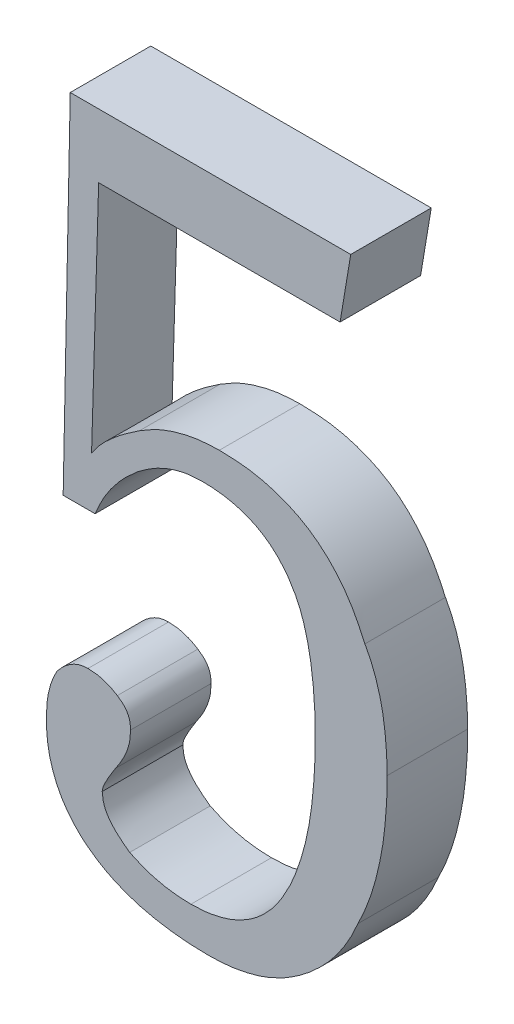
ISO-10303-21;
HEADER;
FILE_DESCRIPTION(('STEP AP214'),'2;1');
FILE_NAME('part.step','',(''),(''),'','','');
FILE_SCHEMA(('AUTOMOTIVE_DESIGN { 1 0 10303 214 1 1 1 1 }'));
ENDSEC;
DATA;
#1=APPLICATION_CONTEXT('core data for automotive mechanical design processes');
#2=APPLICATION_PROTOCOL_DEFINITION('international standard','automotive_design',2000,#1);
#3=PRODUCT_CONTEXT('',#1,'mechanical');
#4=PRODUCT('Part','Part','',(#3));
#5=PRODUCT_RELATED_PRODUCT_CATEGORY('part','',(#4));
#6=PRODUCT_DEFINITION_FORMATION('','',#4);
#7=PRODUCT_DEFINITION_CONTEXT('part definition',#1,'design');
#8=PRODUCT_DEFINITION('design','',#6,#7);
#9=PRODUCT_DEFINITION_SHAPE('','',#8);
#10=(LENGTH_UNIT() NAMED_UNIT(*) SI_UNIT(.MILLI.,.METRE.));
#11=(NAMED_UNIT(*) PLANE_ANGLE_UNIT() SI_UNIT($,.RADIAN.));
#12=(NAMED_UNIT(*) SI_UNIT($,.STERADIAN.) SOLID_ANGLE_UNIT());
#13=UNCERTAINTY_MEASURE_WITH_UNIT(LENGTH_MEASURE(1.E-05),#10,'distance_accuracy_value','');
#14=(GEOMETRIC_REPRESENTATION_CONTEXT(3) GLOBAL_UNCERTAINTY_ASSIGNED_CONTEXT((#13)) GLOBAL_UNIT_ASSIGNED_CONTEXT((#10,
#11,#12)) REPRESENTATION_CONTEXT('',''));
#15=CARTESIAN_POINT('',(0.,0.,0.));
#16=DIRECTION('',(0.,0.,1.));
#17=DIRECTION('',(1.,0.,0.));
#18=AXIS2_PLACEMENT_3D('',#15,#16,#17);
#19=CARTESIAN_POINT('',(3.04232804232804,23.6772486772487,3.));
#20=DIRECTION('',(0.,1.,0.));
#21=DIRECTION('',(0.,0.,1.));
#22=AXIS2_PLACEMENT_3D('',#19,#20,#21);
#23=PLANE('',#22);
#24=DIRECTION('',(1.,0.,0.));
#25=VECTOR('',#24,1.);
#26=CARTESIAN_POINT('',(3.04232804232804,23.6772486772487,0.));
#27=LINE('',#26,#25);
#28=CARTESIAN_POINT('',(3.04232804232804,23.6772486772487,0.));
#29=VERTEX_POINT('',#28);
#30=CARTESIAN_POINT('',(13.4920634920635,23.6772486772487,0.));
#31=VERTEX_POINT('',#30);
#32=EDGE_CURVE('E646',#29,#31,#27,.T.);
#33=ORIENTED_EDGE('',*,*,#32,.F.);
#34=DIRECTION('',(0.,0.,-1.));
#35=VECTOR('',#34,1.);
#36=CARTESIAN_POINT('',(3.04232804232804,23.6772486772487,3.));
#37=LINE('',#36,#35);
#38=CARTESIAN_POINT('',(3.04232804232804,23.6772486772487,3.));
#39=VERTEX_POINT('',#38);
#40=EDGE_CURVE('E11',#39,#29,#37,.T.);
#41=ORIENTED_EDGE('',*,*,#40,.F.);
#42=DIRECTION('',(1.,0.,0.));
#43=VECTOR('',#42,1.);
#44=CARTESIAN_POINT('',(3.04232804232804,23.6772486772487,3.));
#45=LINE('',#44,#43);
#46=CARTESIAN_POINT('',(13.4920634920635,23.6772486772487,3.));
#47=VERTEX_POINT('',#46);
#48=EDGE_CURVE('E555',#39,#47,#45,.T.);
#49=ORIENTED_EDGE('',*,*,#48,.T.);
#50=DIRECTION('',(0.,0.,-1.));
#51=VECTOR('',#50,1.);
#52=CARTESIAN_POINT('',(13.4920634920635,23.6772486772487,3.));
#53=LINE('',#52,#51);
#54=EDGE_CURVE('E42',#47,#31,#53,.T.);
#55=ORIENTED_EDGE('',*,*,#54,.T.);
#56=EDGE_LOOP('',(#33,#41,#49,#55));
#57=FACE_BOUND('',#56,.T.);
#58=ADVANCED_FACE('F39',(#57),#23,.T.);
#59=CARTESIAN_POINT('',(2.77777777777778,10.5477170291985,3.));
#60=DIRECTION('',(-0.999797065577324,0.0201451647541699,0.));
#61=DIRECTION('',(-0.0201451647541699,-0.999797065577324,0.));
#62=AXIS2_PLACEMENT_3D('',#59,#60,#61);
#63=PLANE('',#62);
#64=DIRECTION('',(0.0201451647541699,0.999797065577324,0.));
#65=VECTOR('',#64,1.);
#66=CARTESIAN_POINT('',(2.77777777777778,10.5477170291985,0.));
#67=LINE('',#66,#65);
#68=CARTESIAN_POINT('',(2.77777777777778,10.5477170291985,0.));
#69=VERTEX_POINT('',#68);
#70=EDGE_CURVE('E557',#69,#29,#67,.T.);
#71=ORIENTED_EDGE('',*,*,#70,.F.);
#72=DIRECTION('',(0.,0.,-1.));
#73=VECTOR('',#72,1.);
#74=CARTESIAN_POINT('',(2.77777777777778,10.5477170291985,3.));
#75=LINE('',#74,#73);
#76=CARTESIAN_POINT('',(2.77777777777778,10.5477170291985,3.));
#77=VERTEX_POINT('',#76);
#78=EDGE_CURVE('E49',#77,#69,#75,.T.);
#79=ORIENTED_EDGE('',*,*,#78,.F.);
#80=DIRECTION('',(0.0201451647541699,0.999797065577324,0.));
#81=VECTOR('',#80,1.);
#82=CARTESIAN_POINT('',(2.77777777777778,10.5477170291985,3.));
#83=LINE('',#82,#81);
#84=EDGE_CURVE('E254',#77,#39,#83,.T.);
#85=ORIENTED_EDGE('',*,*,#84,.T.);
#86=ORIENTED_EDGE('',*,*,#40,.T.);
#87=EDGE_LOOP('',(#71,#79,#85,#86));
#88=FACE_BOUND('',#87,.T.);
#89=ADVANCED_FACE('F907',(#88),#63,.T.);
#90=CARTESIAN_POINT('',(3.96825396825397,10.5477170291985,3.));
#91=DIRECTION('',(0.,-1.,0.));
#92=DIRECTION('',(0.,0.,-1.));
#93=AXIS2_PLACEMENT_3D('',#90,#91,#92);
#94=PLANE('',#93);
#95=DIRECTION('',(-1.,0.,0.));
#96=VECTOR('',#95,1.);
#97=CARTESIAN_POINT('',(3.96825396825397,10.5477170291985,0.));
#98=LINE('',#97,#96);
#99=CARTESIAN_POINT('',(3.96825396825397,10.5477170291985,0.));
#100=VERTEX_POINT('',#99);
#101=EDGE_CURVE('E240',#100,#69,#98,.T.);
#102=ORIENTED_EDGE('',*,*,#101,.F.);
#103=DIRECTION('',(0.,0.,-1.));
#104=VECTOR('',#103,1.);
#105=CARTESIAN_POINT('',(3.96825396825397,10.5477170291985,3.));
#106=LINE('',#105,#104);
#107=CARTESIAN_POINT('',(3.96825396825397,10.5477170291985,3.));
#108=VERTEX_POINT('',#107);
#109=EDGE_CURVE('E235',#108,#100,#106,.T.);
#110=ORIENTED_EDGE('',*,*,#109,.F.);
#111=DIRECTION('',(-1.,0.,0.));
#112=VECTOR('',#111,1.);
#113=CARTESIAN_POINT('',(3.96825396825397,10.5477170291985,3.));
#114=LINE('',#113,#112);
#115=EDGE_CURVE('E238',#108,#77,#114,.T.);
#116=ORIENTED_EDGE('',*,*,#115,.T.);
#117=ORIENTED_EDGE('',*,*,#78,.T.);
#118=EDGE_LOOP('',(#102,#110,#116,#117));
#119=FACE_BOUND('',#118,.T.);
#120=ADVANCED_FACE('F237',(#119),#94,.T.);
#121=CARTESIAN_POINT('',(5.55555555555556,12.6984126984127,3.));
#122=CARTESIAN_POINT('',(5.37785612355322,12.5429418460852,3.));
#123=CARTESIAN_POINT('',(5.02978362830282,12.2384100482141,3.));
#124=CARTESIAN_POINT('',(4.59335087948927,11.7103783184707,3.));
#125=CARTESIAN_POINT('',(4.22693903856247,11.1524064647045,3.));
#126=CARTESIAN_POINT('',(4.05404490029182,10.7482576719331,3.));
#127=CARTESIAN_POINT('',(3.96825396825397,10.5477170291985,3.));
#128=B_SPLINE_CURVE_WITH_KNOTS('',3,(#121,#122,#123,#124,#125,#126,#127),.UNSPECIFIED.,.F.,.F.,
(4,1,1,1,4),(0.,0.261774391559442,0.512756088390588,0.758227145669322,1.),.UNSPECIFIED.);
#129=DIRECTION('',(0.,0.,-1.));
#130=VECTOR('',#129,1.);
#131=SURFACE_OF_LINEAR_EXTRUSION('',#128,#130);
#132=CARTESIAN_POINT('',(5.55555555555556,12.6984126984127,0.));
#133=CARTESIAN_POINT('',(5.37785612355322,12.5429418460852,0.));
#134=CARTESIAN_POINT('',(5.02978362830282,12.2384100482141,0.));
#135=CARTESIAN_POINT('',(4.59335087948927,11.7103783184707,0.));
#136=CARTESIAN_POINT('',(4.22693903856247,11.1524064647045,0.));
#137=CARTESIAN_POINT('',(4.05404490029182,10.7482576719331,0.));
#138=CARTESIAN_POINT('',(3.96825396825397,10.5477170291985,0.));
#139=B_SPLINE_CURVE_WITH_KNOTS('',3,(#132,#133,#134,#135,#136,#137,#138),.UNSPECIFIED.,.F.,.F.,
(4,1,1,1,4),(0.,0.261774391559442,0.512756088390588,0.758227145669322,1.),.UNSPECIFIED.);
#140=CARTESIAN_POINT('',(5.55555555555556,12.6984126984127,0.));
#141=VERTEX_POINT('',#140);
#142=EDGE_CURVE('E564',#141,#100,#139,.T.);
#143=ORIENTED_EDGE('',*,*,#142,.F.);
#144=DIRECTION('',(0.,0.,-1.));
#145=VECTOR('',#144,1.);
#146=CARTESIAN_POINT('',(5.55555555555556,12.6984126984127,3.));
#147=LINE('',#146,#145);
#148=CARTESIAN_POINT('',(5.55555555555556,12.6984126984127,3.));
#149=VERTEX_POINT('',#148);
#150=EDGE_CURVE('E246',#149,#141,#147,.T.);
#151=ORIENTED_EDGE('',*,*,#150,.F.);
#152=EDGE_CURVE('E252',#149,#108,#128,.T.);
#153=ORIENTED_EDGE('',*,*,#152,.T.);
#154=ORIENTED_EDGE('',*,*,#109,.T.);
#155=EDGE_LOOP('',(#143,#151,#153,#154));
#156=FACE_BOUND('',#155,.T.);
#157=ADVANCED_FACE('F257',(#156),#131,.T.);
#158=CARTESIAN_POINT('',(7.93650793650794,13.5900450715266,3.));
#159=CARTESIAN_POINT('',(7.72956632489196,13.5800889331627,3.));
#160=CARTESIAN_POINT('',(7.31382858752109,13.5600874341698,3.));
#161=CARTESIAN_POINT('',(6.70248888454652,13.3819907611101,3.));
#162=CARTESIAN_POINT('',(6.10483466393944,13.1015734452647,3.));
#163=CARTESIAN_POINT('',(5.74255660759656,12.8356680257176,3.));
#164=CARTESIAN_POINT('',(5.55555555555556,12.6984126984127,3.));
#165=B_SPLINE_CURVE_WITH_KNOTS('',3,(#158,#159,#160,#161,#162,#163,#164),.UNSPECIFIED.,.F.,.F.,
(4,1,1,1,4),(0.,0.239237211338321,0.480618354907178,0.731905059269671,1.),.UNSPECIFIED.);
#166=DIRECTION('',(0.,0.,-1.));
#167=VECTOR('',#166,1.);
#168=SURFACE_OF_LINEAR_EXTRUSION('',#165,#167);
#169=CARTESIAN_POINT('',(7.93650793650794,13.5900450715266,0.));
#170=CARTESIAN_POINT('',(7.72956632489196,13.5800889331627,0.));
#171=CARTESIAN_POINT('',(7.31382858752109,13.5600874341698,0.));
#172=CARTESIAN_POINT('',(6.70248888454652,13.3819907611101,0.));
#173=CARTESIAN_POINT('',(6.10483466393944,13.1015734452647,0.));
#174=CARTESIAN_POINT('',(5.74255660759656,12.8356680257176,0.));
#175=CARTESIAN_POINT('',(5.55555555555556,12.6984126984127,0.));
#176=B_SPLINE_CURVE_WITH_KNOTS('',3,(#169,#170,#171,#172,#173,#174,#175),.UNSPECIFIED.,.F.,.F.,
(4,1,1,1,4),(0.,0.239237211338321,0.480618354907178,0.731905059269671,1.),.UNSPECIFIED.);
#177=CARTESIAN_POINT('',(7.93650793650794,13.5900450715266,0.));
#178=VERTEX_POINT('',#177);
#179=EDGE_CURVE('E847',#178,#141,#176,.T.);
#180=ORIENTED_EDGE('',*,*,#179,.F.);
#181=DIRECTION('',(0.,0.,-1.));
#182=VECTOR('',#181,1.);
#183=CARTESIAN_POINT('',(7.93650793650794,13.5900450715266,3.));
#184=LINE('',#183,#182);
#185=CARTESIAN_POINT('',(7.93650793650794,13.5900450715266,3.));
#186=VERTEX_POINT('',#185);
#187=EDGE_CURVE('E572',#186,#178,#184,.T.);
#188=ORIENTED_EDGE('',*,*,#187,.F.);
#189=EDGE_CURVE('E259',#186,#149,#165,.T.);
#190=ORIENTED_EDGE('',*,*,#189,.T.);
#191=ORIENTED_EDGE('',*,*,#150,.T.);
#192=EDGE_LOOP('',(#180,#188,#190,#191));
#193=FACE_BOUND('',#192,.T.);
#194=ADVANCED_FACE('F279',(#193),#168,.T.);
#195=CARTESIAN_POINT('',(11.4442484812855,11.6402116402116,3.));
#196=CARTESIAN_POINT('',(11.355325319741,11.7948264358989,3.));
#197=CARTESIAN_POINT('',(11.1812237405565,12.0975448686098,3.));
#198=CARTESIAN_POINT('',(10.8526161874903,12.4990541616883,3.));
#199=CARTESIAN_POINT('',(10.4785498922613,12.8401256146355,3.));
#200=CARTESIAN_POINT('',(10.0570092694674,13.1179252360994,3.));
#201=CARTESIAN_POINT('',(9.58996336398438,13.3291749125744,3.));
#202=CARTESIAN_POINT('',(9.07917448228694,13.4806704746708,3.));
#203=CARTESIAN_POINT('',(8.52303906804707,13.5758947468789,3.));
#204=CARTESIAN_POINT('',(8.1361375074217,13.5852289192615,3.));
#205=CARTESIAN_POINT('',(7.93650793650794,13.5900450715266,3.));
#206=B_SPLINE_CURVE_WITH_KNOTS('',3,(#195,#196,#197,#198,#199,#200,#201,#202,#203,#204,#205),
.UNSPECIFIED.,.F.,.F.,(4,1,1,1,1,1,1,1,4),(0.,0.126004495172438,0.246702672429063,
0.365281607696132,0.482866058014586,0.602274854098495,0.726530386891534,0.858897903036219,1.),.UNSPECIFIED.);
#207=DIRECTION('',(0.,0.,-1.));
#208=VECTOR('',#207,1.);
#209=SURFACE_OF_LINEAR_EXTRUSION('',#206,#208);
#210=CARTESIAN_POINT('',(11.4442484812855,11.6402116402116,0.));
#211=CARTESIAN_POINT('',(11.355325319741,11.7948264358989,0.));
#212=CARTESIAN_POINT('',(11.1812237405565,12.0975448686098,0.));
#213=CARTESIAN_POINT('',(10.8526161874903,12.4990541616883,0.));
#214=CARTESIAN_POINT('',(10.4785498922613,12.8401256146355,0.));
#215=CARTESIAN_POINT('',(10.0570092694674,13.1179252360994,0.));
#216=CARTESIAN_POINT('',(9.58996336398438,13.3291749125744,0.));
#217=CARTESIAN_POINT('',(9.07917448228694,13.4806704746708,0.));
#218=CARTESIAN_POINT('',(8.52303906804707,13.5758947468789,0.));
#219=CARTESIAN_POINT('',(8.1361375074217,13.5852289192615,0.));
#220=CARTESIAN_POINT('',(7.93650793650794,13.5900450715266,0.));
#221=B_SPLINE_CURVE_WITH_KNOTS('',3,(#210,#211,#212,#213,#214,#215,#216,#217,#218,#219,#220),
.UNSPECIFIED.,.F.,.F.,(4,1,1,1,1,1,1,1,4),(0.,0.126004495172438,0.246702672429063,
0.365281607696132,0.482866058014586,0.602274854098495,0.726530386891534,0.858897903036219,1.),.UNSPECIFIED.);
#222=CARTESIAN_POINT('',(11.4442484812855,11.6402116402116,0.));
#223=VERTEX_POINT('',#222);
#224=EDGE_CURVE('E838',#223,#178,#221,.T.);
#225=ORIENTED_EDGE('',*,*,#224,.F.);
#226=DIRECTION('',(0.,0.,-1.));
#227=VECTOR('',#226,1.);
#228=CARTESIAN_POINT('',(11.4442484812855,11.6402116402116,3.));
#229=LINE('',#228,#227);
#230=CARTESIAN_POINT('',(11.4442484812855,11.6402116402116,3.));
#231=VERTEX_POINT('',#230);
#232=EDGE_CURVE('E575',#231,#223,#229,.T.);
#233=ORIENTED_EDGE('',*,*,#232,.F.);
#234=EDGE_CURVE('E262',#231,#186,#206,.T.);
#235=ORIENTED_EDGE('',*,*,#234,.T.);
#236=ORIENTED_EDGE('',*,*,#187,.T.);
#237=EDGE_LOOP('',(#225,#233,#235,#236));
#238=FACE_BOUND('',#237,.T.);
#239=ADVANCED_FACE('F283',(#238),#209,.T.);
#240=CARTESIAN_POINT('',(12.1693121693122,7.40740740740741,3.));
#241=CARTESIAN_POINT('',(12.1679059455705,7.63444032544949,3.));
#242=CARTESIAN_POINT('',(12.1651827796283,8.0740917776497,3.));
#243=CARTESIAN_POINT('',(12.1307680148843,8.71325850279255,3.));
#244=CARTESIAN_POINT('',(12.0719949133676,9.30804383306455,3.));
#245=CARTESIAN_POINT('',(11.9954011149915,9.86120605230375,3.));
#246=CARTESIAN_POINT('',(11.893159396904,10.3682347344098,3.));
#247=CARTESIAN_POINT('',(11.7706948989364,10.8333687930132,3.));
#248=CARTESIAN_POINT('',(11.6276553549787,11.2564823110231,3.));
#249=CARTESIAN_POINT('',(11.5038569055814,11.5154971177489,3.));
#250=CARTESIAN_POINT('',(11.4442484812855,11.6402116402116,3.));
#251=B_SPLINE_CURVE_WITH_KNOTS('',3,(#240,#241,#242,#243,#244,#245,#246,#247,#248,#249,#250),
.UNSPECIFIED.,.F.,.F.,(4,1,1,1,1,1,1,1,4),(0.,0.157263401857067,0.304542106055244,
0.443223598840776,0.571212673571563,0.691239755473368,0.801276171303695,0.904315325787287,1.),.UNSPECIFIED.);
#252=DIRECTION('',(0.,0.,-1.));
#253=VECTOR('',#252,1.);
#254=SURFACE_OF_LINEAR_EXTRUSION('',#251,#253);
#255=CARTESIAN_POINT('',(12.1693121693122,7.40740740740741,0.));
#256=CARTESIAN_POINT('',(12.1679059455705,7.63444032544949,0.));
#257=CARTESIAN_POINT('',(12.1651827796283,8.0740917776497,0.));
#258=CARTESIAN_POINT('',(12.1307680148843,8.71325850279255,0.));
#259=CARTESIAN_POINT('',(12.0719949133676,9.30804383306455,0.));
#260=CARTESIAN_POINT('',(11.9954011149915,9.86120605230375,0.));
#261=CARTESIAN_POINT('',(11.893159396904,10.3682347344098,0.));
#262=CARTESIAN_POINT('',(11.7706948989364,10.8333687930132,0.));
#263=CARTESIAN_POINT('',(11.6276553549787,11.2564823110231,0.));
#264=CARTESIAN_POINT('',(11.5038569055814,11.5154971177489,0.));
#265=CARTESIAN_POINT('',(11.4442484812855,11.6402116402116,0.));
#266=B_SPLINE_CURVE_WITH_KNOTS('',3,(#255,#256,#257,#258,#259,#260,#261,#262,#263,#264,#265),
.UNSPECIFIED.,.F.,.F.,(4,1,1,1,1,1,1,1,4),(0.,0.157263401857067,0.304542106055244,
0.443223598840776,0.571212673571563,0.691239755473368,0.801276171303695,0.904315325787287,1.),.UNSPECIFIED.);
#267=CARTESIAN_POINT('',(12.1693121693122,7.40740740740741,0.));
#268=VERTEX_POINT('',#267);
#269=EDGE_CURVE('E829',#268,#223,#266,.T.);
#270=ORIENTED_EDGE('',*,*,#269,.F.);
#271=DIRECTION('',(0.,0.,-1.));
#272=VECTOR('',#271,1.);
#273=CARTESIAN_POINT('',(12.1693121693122,7.40740740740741,3.));
#274=LINE('',#273,#272);
#275=CARTESIAN_POINT('',(12.1693121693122,7.40740740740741,3.));
#276=VERTEX_POINT('',#275);
#277=EDGE_CURVE('E578',#276,#268,#274,.T.);
#278=ORIENTED_EDGE('',*,*,#277,.F.);
#279=EDGE_CURVE('E296',#276,#231,#251,.T.);
#280=ORIENTED_EDGE('',*,*,#279,.T.);
#281=ORIENTED_EDGE('',*,*,#232,.T.);
#282=EDGE_LOOP('',(#270,#278,#280,#281));
#283=FACE_BOUND('',#282,.T.);
#284=ADVANCED_FACE('F287',(#283),#254,.T.);
#285=CARTESIAN_POINT('',(10.9445424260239,1.65588869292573,3.));
#286=CARTESIAN_POINT('',(11.0447719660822,1.83360375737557,3.));
#287=CARTESIAN_POINT('',(11.2493873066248,2.19640327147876,3.));
#288=CARTESIAN_POINT('',(11.4899359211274,2.7924535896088,3.));
#289=CARTESIAN_POINT('',(11.7006122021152,3.43570319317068,3.));
#290=CARTESIAN_POINT('',(11.8775483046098,4.13076132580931,3.));
#291=CARTESIAN_POINT('',(12.0074263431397,4.877885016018,3.));
#292=CARTESIAN_POINT('',(12.0981616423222,5.67463600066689,3.));
#293=CARTESIAN_POINT('',(12.1592836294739,6.52299562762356,3.));
#294=CARTESIAN_POINT('',(12.1659037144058,7.10681751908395,3.));
#295=CARTESIAN_POINT('',(12.1693121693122,7.40740740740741,3.));
#296=B_SPLINE_CURVE_WITH_KNOTS('',3,(#285,#286,#287,#288,#289,#290,#291,#292,#293,#294,#295),
.UNSPECIFIED.,.F.,.F.,(4,1,1,1,1,1,1,1,4),(0.,0.102808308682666,0.209879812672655,
0.323438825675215,0.44409384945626,0.571244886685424,0.705587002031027,0.848416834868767,1.),.UNSPECIFIED.);
#297=DIRECTION('',(0.,0.,-1.));
#298=VECTOR('',#297,1.);
#299=SURFACE_OF_LINEAR_EXTRUSION('',#296,#298);
#300=CARTESIAN_POINT('',(10.9445424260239,1.65588869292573,0.));
#301=CARTESIAN_POINT('',(11.0447719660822,1.83360375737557,0.));
#302=CARTESIAN_POINT('',(11.2493873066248,2.19640327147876,0.));
#303=CARTESIAN_POINT('',(11.4899359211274,2.7924535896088,0.));
#304=CARTESIAN_POINT('',(11.7006122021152,3.43570319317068,0.));
#305=CARTESIAN_POINT('',(11.8775483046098,4.13076132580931,0.));
#306=CARTESIAN_POINT('',(12.0074263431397,4.877885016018,0.));
#307=CARTESIAN_POINT('',(12.0981616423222,5.67463600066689,0.));
#308=CARTESIAN_POINT('',(12.1592836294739,6.52299562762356,0.));
#309=CARTESIAN_POINT('',(12.1659037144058,7.10681751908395,0.));
#310=CARTESIAN_POINT('',(12.1693121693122,7.40740740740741,0.));
#311=B_SPLINE_CURVE_WITH_KNOTS('',3,(#300,#301,#302,#303,#304,#305,#306,#307,#308,#309,#310),
.UNSPECIFIED.,.F.,.F.,(4,1,1,1,1,1,1,1,4),(0.,0.102808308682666,0.209879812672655,
0.323438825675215,0.44409384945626,0.571244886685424,0.705587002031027,0.848416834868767,1.),.UNSPECIFIED.);
#312=CARTESIAN_POINT('',(10.9445424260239,1.65588869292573,0.));
#313=VERTEX_POINT('',#312);
#314=EDGE_CURVE('E820',#313,#268,#311,.T.);
#315=ORIENTED_EDGE('',*,*,#314,.F.);
#316=DIRECTION('',(0.,0.,-1.));
#317=VECTOR('',#316,1.);
#318=CARTESIAN_POINT('',(10.9445424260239,1.65588869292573,3.));
#319=LINE('',#318,#317);
#320=CARTESIAN_POINT('',(10.9445424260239,1.65588869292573,3.));
#321=VERTEX_POINT('',#320);
#322=EDGE_CURVE('E581',#321,#313,#319,.T.);
#323=ORIENTED_EDGE('',*,*,#322,.F.);
#324=EDGE_CURVE('E306',#321,#276,#296,.T.);
#325=ORIENTED_EDGE('',*,*,#324,.T.);
#326=ORIENTED_EDGE('',*,*,#277,.T.);
#327=EDGE_LOOP('',(#315,#323,#325,#326));
#328=FACE_BOUND('',#327,.T.);
#329=ADVANCED_FACE('F324',(#328),#299,.T.);
#330=CARTESIAN_POINT('',(7.53968253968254,-0.264550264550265,3.));
#331=CARTESIAN_POINT('',(7.72142966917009,-0.259724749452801,3.));
#332=CARTESIAN_POINT('',(8.07763710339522,-0.250267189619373,3.));
#333=CARTESIAN_POINT('',(8.59171924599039,-0.152393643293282,3.));
#334=CARTESIAN_POINT('',(9.07525810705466,-0.00881416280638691,3.));
#335=CARTESIAN_POINT('',(9.51961861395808,0.207690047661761,3.));
#336=CARTESIAN_POINT('',(9.93646079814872,0.475222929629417,3.));
#337=CARTESIAN_POINT('',(10.3072075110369,0.817022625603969,3.));
#338=CARTESIAN_POINT('',(10.6585814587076,1.20284529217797,3.));
#339=CARTESIAN_POINT('',(10.8476528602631,1.50238809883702,3.));
#340=CARTESIAN_POINT('',(10.9445424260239,1.65588869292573,3.));
#341=B_SPLINE_CURVE_WITH_KNOTS('',3,(#330,#331,#332,#333,#334,#335,#336,#337,#338,#339,#340),
.UNSPECIFIED.,.F.,.F.,(4,1,1,1,1,1,1,1,4),(0.,0.132648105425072,0.259977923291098,
0.381136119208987,0.500160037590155,0.61997093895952,0.741662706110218,0.867615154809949,1.),.UNSPECIFIED.);
#342=DIRECTION('',(0.,0.,-1.));
#343=VECTOR('',#342,1.);
#344=SURFACE_OF_LINEAR_EXTRUSION('',#341,#343);
#345=CARTESIAN_POINT('',(7.53968253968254,-0.264550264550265,0.));
#346=CARTESIAN_POINT('',(7.72142966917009,-0.259724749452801,0.));
#347=CARTESIAN_POINT('',(8.07763710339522,-0.250267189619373,0.));
#348=CARTESIAN_POINT('',(8.59171924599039,-0.152393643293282,0.));
#349=CARTESIAN_POINT('',(9.07525810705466,-0.00881416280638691,0.));
#350=CARTESIAN_POINT('',(9.51961861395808,0.207690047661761,0.));
#351=CARTESIAN_POINT('',(9.93646079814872,0.475222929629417,0.));
#352=CARTESIAN_POINT('',(10.3072075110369,0.817022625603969,0.));
#353=CARTESIAN_POINT('',(10.6585814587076,1.20284529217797,0.));
#354=CARTESIAN_POINT('',(10.8476528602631,1.50238809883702,0.));
#355=CARTESIAN_POINT('',(10.9445424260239,1.65588869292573,0.));
#356=B_SPLINE_CURVE_WITH_KNOTS('',3,(#345,#346,#347,#348,#349,#350,#351,#352,#353,#354,#355),
.UNSPECIFIED.,.F.,.F.,(4,1,1,1,1,1,1,1,4),(0.,0.132648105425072,0.259977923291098,
0.381136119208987,0.500160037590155,0.61997093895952,0.741662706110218,0.867615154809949,1.),.UNSPECIFIED.);
#357=CARTESIAN_POINT('',(7.53968253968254,-0.264550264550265,0.));
#358=VERTEX_POINT('',#357);
#359=EDGE_CURVE('E811',#358,#313,#356,.T.);
#360=ORIENTED_EDGE('',*,*,#359,.F.);
#361=DIRECTION('',(0.,0.,-1.));
#362=VECTOR('',#361,1.);
#363=CARTESIAN_POINT('',(7.53968253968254,-0.264550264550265,3.));
#364=LINE('',#363,#362);
#365=CARTESIAN_POINT('',(7.53968253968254,-0.264550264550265,3.));
#366=VERTEX_POINT('',#365);
#367=EDGE_CURVE('E584',#366,#358,#364,.T.);
#368=ORIENTED_EDGE('',*,*,#367,.F.);
#369=EDGE_CURVE('E316',#366,#321,#341,.T.);
#370=ORIENTED_EDGE('',*,*,#369,.T.);
#371=ORIENTED_EDGE('',*,*,#322,.T.);
#372=EDGE_LOOP('',(#360,#368,#370,#371));
#373=FACE_BOUND('',#372,.T.);
#374=ADVANCED_FACE('F327',(#373),#344,.T.);
#375=CARTESIAN_POINT('',(5.25671173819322,0.264550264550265,3.));
#376=CARTESIAN_POINT('',(5.43129636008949,0.183257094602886,3.));
#377=CARTESIAN_POINT('',(5.78221240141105,0.0198573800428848,3.));
#378=CARTESIAN_POINT('',(6.34460099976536,-0.143736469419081,3.));
#379=CARTESIAN_POINT('',(6.93342840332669,-0.244746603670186,3.));
#380=CARTESIAN_POINT('',(7.33513242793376,-0.257868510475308,3.));
#381=CARTESIAN_POINT('',(7.53968253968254,-0.264550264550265,3.));
#382=B_SPLINE_CURVE_WITH_KNOTS('',3,(#375,#376,#377,#378,#379,#380,#381),.UNSPECIFIED.,.F.,.F.,
(4,1,1,1,4),(0.,0.244055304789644,0.490552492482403,0.740586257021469,1.),.UNSPECIFIED.);
#383=DIRECTION('',(0.,0.,-1.));
#384=VECTOR('',#383,1.);
#385=SURFACE_OF_LINEAR_EXTRUSION('',#382,#384);
#386=CARTESIAN_POINT('',(5.25671173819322,0.264550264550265,0.));
#387=CARTESIAN_POINT('',(5.43129636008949,0.183257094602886,0.));
#388=CARTESIAN_POINT('',(5.78221240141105,0.0198573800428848,0.));
#389=CARTESIAN_POINT('',(6.34460099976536,-0.143736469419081,0.));
#390=CARTESIAN_POINT('',(6.93342840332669,-0.244746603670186,0.));
#391=CARTESIAN_POINT('',(7.33513242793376,-0.257868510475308,0.));
#392=CARTESIAN_POINT('',(7.53968253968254,-0.264550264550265,0.));
#393=B_SPLINE_CURVE_WITH_KNOTS('',3,(#386,#387,#388,#389,#390,#391,#392),.UNSPECIFIED.,.F.,.F.,
(4,1,1,1,4),(0.,0.244055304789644,0.490552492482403,0.740586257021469,1.),.UNSPECIFIED.);
#394=CARTESIAN_POINT('',(5.25671173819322,0.264550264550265,0.));
#395=VERTEX_POINT('',#394);
#396=EDGE_CURVE('E802',#395,#358,#393,.T.);
#397=ORIENTED_EDGE('',*,*,#396,.F.);
#398=DIRECTION('',(0.,0.,-1.));
#399=VECTOR('',#398,1.);
#400=CARTESIAN_POINT('',(5.25671173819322,0.264550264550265,3.));
#401=LINE('',#400,#399);
#402=CARTESIAN_POINT('',(5.25671173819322,0.264550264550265,3.));
#403=VERTEX_POINT('',#402);
#404=EDGE_CURVE('E587',#403,#395,#401,.T.);
#405=ORIENTED_EDGE('',*,*,#404,.F.);
#406=EDGE_CURVE('E339',#403,#366,#382,.T.);
#407=ORIENTED_EDGE('',*,*,#406,.T.);
#408=ORIENTED_EDGE('',*,*,#367,.T.);
#409=EDGE_LOOP('',(#397,#405,#407,#408));
#410=FACE_BOUND('',#409,.T.);
#411=ADVANCED_FACE('F331',(#410),#385,.T.);
#412=CARTESIAN_POINT('',(4.23280423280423,1.71957671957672,3.));
#413=CARTESIAN_POINT('',(4.2458637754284,1.59154820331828,3.));
#414=CARTESIAN_POINT('',(4.27306059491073,1.32492566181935,3.));
#415=CARTESIAN_POINT('',(4.48733557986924,0.944686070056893,3.));
#416=CARTESIAN_POINT('',(4.82165212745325,0.585823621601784,3.));
#417=CARTESIAN_POINT('',(5.1039573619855,0.377352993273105,3.));
#418=CARTESIAN_POINT('',(5.25671173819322,0.264550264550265,3.));
#419=B_SPLINE_CURVE_WITH_KNOTS('',3,(#412,#413,#414,#415,#416,#417,#418),.UNSPECIFIED.,.F.,.F.,
(4,1,1,1,4),(0.,0.207093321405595,0.431276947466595,0.692265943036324,1.),.UNSPECIFIED.);
#420=DIRECTION('',(0.,0.,-1.));
#421=VECTOR('',#420,1.);
#422=SURFACE_OF_LINEAR_EXTRUSION('',#419,#421);
#423=CARTESIAN_POINT('',(4.23280423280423,1.71957671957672,0.));
#424=CARTESIAN_POINT('',(4.2458637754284,1.59154820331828,0.));
#425=CARTESIAN_POINT('',(4.27306059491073,1.32492566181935,0.));
#426=CARTESIAN_POINT('',(4.48733557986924,0.944686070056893,0.));
#427=CARTESIAN_POINT('',(4.82165212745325,0.585823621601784,0.));
#428=CARTESIAN_POINT('',(5.1039573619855,0.377352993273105,0.));
#429=CARTESIAN_POINT('',(5.25671173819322,0.264550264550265,0.));
#430=B_SPLINE_CURVE_WITH_KNOTS('',3,(#423,#424,#425,#426,#427,#428,#429),.UNSPECIFIED.,.F.,.F.,
(4,1,1,1,4),(0.,0.207093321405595,0.431276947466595,0.692265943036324,1.),.UNSPECIFIED.);
#431=CARTESIAN_POINT('',(4.23280423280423,1.71957671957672,0.));
#432=VERTEX_POINT('',#431);
#433=EDGE_CURVE('E793',#432,#395,#430,.T.);
#434=ORIENTED_EDGE('',*,*,#433,.F.);
#435=DIRECTION('',(0.,0.,-1.));
#436=VECTOR('',#435,1.);
#437=CARTESIAN_POINT('',(4.23280423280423,1.71957671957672,3.));
#438=LINE('',#437,#436);
#439=CARTESIAN_POINT('',(4.23280423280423,1.71957671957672,3.));
#440=VERTEX_POINT('',#439);
#441=EDGE_CURVE('E590',#440,#432,#438,.T.);
#442=ORIENTED_EDGE('',*,*,#441,.F.);
#443=EDGE_CURVE('E345',#440,#403,#419,.T.);
#444=ORIENTED_EDGE('',*,*,#443,.T.);
#445=ORIENTED_EDGE('',*,*,#404,.T.);
#446=EDGE_LOOP('',(#434,#442,#444,#445));
#447=FACE_BOUND('',#446,.T.);
#448=ADVANCED_FACE('F335',(#447),#422,.T.);
#449=CARTESIAN_POINT('',(4.72761120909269,2.71408975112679,3.));
#450=CARTESIAN_POINT('',(4.65429679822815,2.59889272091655,3.));
#451=CARTESIAN_POINT('',(4.52284061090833,2.39233902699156,3.));
#452=CARTESIAN_POINT('',(4.36792195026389,2.11016635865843,3.));
#453=CARTESIAN_POINT('',(4.26092839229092,1.89632640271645,3.));
#454=CARTESIAN_POINT('',(4.24068978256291,1.76913441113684,3.));
#455=CARTESIAN_POINT('',(4.23280423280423,1.71957671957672,3.));
#456=B_SPLINE_CURVE_WITH_KNOTS('',3,(#449,#450,#451,#452,#453,#454,#455),.UNSPECIFIED.,.F.,.F.,
(4,1,1,1,4),(0.,0.365884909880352,0.656048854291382,0.865986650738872,1.),.UNSPECIFIED.);
#457=DIRECTION('',(0.,0.,-1.));
#458=VECTOR('',#457,1.);
#459=SURFACE_OF_LINEAR_EXTRUSION('',#456,#458);
#460=CARTESIAN_POINT('',(4.72761120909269,2.71408975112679,0.));
#461=CARTESIAN_POINT('',(4.65429679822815,2.59889272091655,0.));
#462=CARTESIAN_POINT('',(4.52284061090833,2.39233902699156,0.));
#463=CARTESIAN_POINT('',(4.36792195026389,2.11016635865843,0.));
#464=CARTESIAN_POINT('',(4.26092839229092,1.89632640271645,0.));
#465=CARTESIAN_POINT('',(4.24068978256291,1.76913441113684,0.));
#466=CARTESIAN_POINT('',(4.23280423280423,1.71957671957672,0.));
#467=B_SPLINE_CURVE_WITH_KNOTS('',3,(#460,#461,#462,#463,#464,#465,#466),.UNSPECIFIED.,.F.,.F.,
(4,1,1,1,4),(0.,0.365884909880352,0.656048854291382,0.865986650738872,1.),.UNSPECIFIED.);
#468=CARTESIAN_POINT('',(4.72761120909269,2.71408975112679,0.));
#469=VERTEX_POINT('',#468);
#470=EDGE_CURVE('E784',#469,#432,#467,.T.);
#471=ORIENTED_EDGE('',*,*,#470,.F.);
#472=DIRECTION('',(0.,0.,-1.));
#473=VECTOR('',#472,1.);
#474=CARTESIAN_POINT('',(4.72761120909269,2.71408975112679,3.));
#475=LINE('',#474,#473);
#476=CARTESIAN_POINT('',(4.72761120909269,2.71408975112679,3.));
#477=VERTEX_POINT('',#476);
#478=EDGE_CURVE('E593',#477,#469,#475,.T.);
#479=ORIENTED_EDGE('',*,*,#478,.F.);
#480=EDGE_CURVE('E355',#477,#440,#456,.T.);
#481=ORIENTED_EDGE('',*,*,#480,.T.);
#482=ORIENTED_EDGE('',*,*,#441,.T.);
#483=EDGE_LOOP('',(#471,#479,#481,#482));
#484=FACE_BOUND('',#483,.T.);
#485=ADVANCED_FACE('F373',(#484),#459,.T.);
#486=CARTESIAN_POINT('',(5.29100529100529,4.23280423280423,3.));
#487=CARTESIAN_POINT('',(5.28448125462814,4.10631105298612,3.));
#488=CARTESIAN_POINT('',(5.27111881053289,3.84722941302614,3.));
#489=CARTESIAN_POINT('',(5.15567834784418,3.46359408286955,3.));
#490=CARTESIAN_POINT('',(4.9765691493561,3.07943307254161,3.));
#491=CARTESIAN_POINT('',(4.81294581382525,2.83931744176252,3.));
#492=CARTESIAN_POINT('',(4.72761120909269,2.71408975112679,3.));
#493=B_SPLINE_CURVE_WITH_KNOTS('',3,(#486,#487,#488,#489,#490,#491,#492),.UNSPECIFIED.,.F.,.F.,
(4,1,1,1,4),(0.,0.230104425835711,0.471296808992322,0.724265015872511,1.),.UNSPECIFIED.);
#494=DIRECTION('',(0.,0.,-1.));
#495=VECTOR('',#494,1.);
#496=SURFACE_OF_LINEAR_EXTRUSION('',#493,#495);
#497=CARTESIAN_POINT('',(5.29100529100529,4.23280423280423,0.));
#498=CARTESIAN_POINT('',(5.28448125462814,4.10631105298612,0.));
#499=CARTESIAN_POINT('',(5.27111881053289,3.84722941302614,0.));
#500=CARTESIAN_POINT('',(5.15567834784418,3.46359408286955,0.));
#501=CARTESIAN_POINT('',(4.9765691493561,3.07943307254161,0.));
#502=CARTESIAN_POINT('',(4.81294581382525,2.83931744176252,0.));
#503=CARTESIAN_POINT('',(4.72761120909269,2.71408975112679,0.));
#504=B_SPLINE_CURVE_WITH_KNOTS('',3,(#497,#498,#499,#500,#501,#502,#503),.UNSPECIFIED.,.F.,.F.,
(4,1,1,1,4),(0.,0.230104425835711,0.471296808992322,0.724265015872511,1.),.UNSPECIFIED.);
#505=CARTESIAN_POINT('',(5.29100529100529,4.23280423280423,0.));
#506=VERTEX_POINT('',#505);
#507=EDGE_CURVE('E775',#506,#469,#504,.T.);
#508=ORIENTED_EDGE('',*,*,#507,.F.);
#509=DIRECTION('',(0.,0.,-1.));
#510=VECTOR('',#509,1.);
#511=CARTESIAN_POINT('',(5.29100529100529,4.23280423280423,3.));
#512=LINE('',#511,#510);
#513=CARTESIAN_POINT('',(5.29100529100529,4.23280423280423,3.));
#514=VERTEX_POINT('',#513);
#515=EDGE_CURVE('E596',#514,#506,#512,.T.);
#516=ORIENTED_EDGE('',*,*,#515,.F.);
#517=EDGE_CURVE('E365',#514,#477,#493,.T.);
#518=ORIENTED_EDGE('',*,*,#517,.T.);
#519=ORIENTED_EDGE('',*,*,#478,.T.);
#520=EDGE_LOOP('',(#508,#516,#518,#519));
#521=FACE_BOUND('',#520,.T.);
#522=ADVANCED_FACE('F376',(#521),#496,.T.);
#523=CARTESIAN_POINT('',(4.79619831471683,5.09504213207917,3.));
#524=CARTESIAN_POINT('',(4.87095782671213,5.04290244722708,3.));
#525=CARTESIAN_POINT('',(5.01458710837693,4.94273077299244,3.));
#526=CARTESIAN_POINT('',(5.17988779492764,4.73858703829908,3.));
#527=CARTESIAN_POINT('',(5.27643901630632,4.49548240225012,3.));
#528=CARTESIAN_POINT('',(5.28606781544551,4.32184326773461,3.));
#529=CARTESIAN_POINT('',(5.29100529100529,4.23280423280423,3.));
#530=B_SPLINE_CURVE_WITH_KNOTS('',3,(#523,#524,#525,#526,#527,#528,#529),.UNSPECIFIED.,.F.,.F.,
(4,1,1,1,4),(0.,0.261321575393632,0.502055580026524,0.744663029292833,1.),.UNSPECIFIED.);
#531=DIRECTION('',(0.,0.,-1.));
#532=VECTOR('',#531,1.);
#533=SURFACE_OF_LINEAR_EXTRUSION('',#530,#532);
#534=CARTESIAN_POINT('',(4.79619831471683,5.09504213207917,0.));
#535=CARTESIAN_POINT('',(4.87095782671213,5.04290244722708,0.));
#536=CARTESIAN_POINT('',(5.01458710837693,4.94273077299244,0.));
#537=CARTESIAN_POINT('',(5.17988779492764,4.73858703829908,0.));
#538=CARTESIAN_POINT('',(5.27643901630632,4.49548240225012,0.));
#539=CARTESIAN_POINT('',(5.28606781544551,4.32184326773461,0.));
#540=CARTESIAN_POINT('',(5.29100529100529,4.23280423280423,0.));
#541=B_SPLINE_CURVE_WITH_KNOTS('',3,(#534,#535,#536,#537,#538,#539,#540),.UNSPECIFIED.,.F.,.F.,
(4,1,1,1,4),(0.,0.261321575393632,0.502055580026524,0.744663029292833,1.),.UNSPECIFIED.);
#542=CARTESIAN_POINT('',(4.79619831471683,5.09504213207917,0.));
#543=VERTEX_POINT('',#542);
#544=EDGE_CURVE('E766',#543,#506,#541,.T.);
#545=ORIENTED_EDGE('',*,*,#544,.F.);
#546=DIRECTION('',(0.,0.,-1.));
#547=VECTOR('',#546,1.);
#548=CARTESIAN_POINT('',(4.79619831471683,5.09504213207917,3.));
#549=LINE('',#548,#547);
#550=CARTESIAN_POINT('',(4.79619831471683,5.09504213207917,3.));
#551=VERTEX_POINT('',#550);
#552=EDGE_CURVE('E599',#551,#543,#549,.T.);
#553=ORIENTED_EDGE('',*,*,#552,.F.);
#554=EDGE_CURVE('E388',#551,#514,#530,.T.);
#555=ORIENTED_EDGE('',*,*,#554,.T.);
#556=ORIENTED_EDGE('',*,*,#515,.T.);
#557=EDGE_LOOP('',(#545,#553,#555,#556));
#558=FACE_BOUND('',#557,.T.);
#559=ADVANCED_FACE('F380',(#558),#533,.T.);
#560=CARTESIAN_POINT('',(3.7037037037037,5.42328042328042,3.));
#561=CARTESIAN_POINT('',(3.80209029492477,5.42012215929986,3.));
#562=CARTESIAN_POINT('',(3.99613189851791,5.41389331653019,3.));
#563=CARTESIAN_POINT('',(4.27793604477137,5.34601771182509,3.));
#564=CARTESIAN_POINT('',(4.54754856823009,5.24349639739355,3.));
#565=CARTESIAN_POINT('',(4.7125657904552,5.14497423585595,3.));
#566=CARTESIAN_POINT('',(4.79619831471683,5.09504213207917,3.));
#567=B_SPLINE_CURVE_WITH_KNOTS('',3,(#560,#561,#562,#563,#564,#565,#566),.UNSPECIFIED.,.F.,.F.,
(4,1,1,1,4),(0.,0.254719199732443,0.50236644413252,0.74779389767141,1.),.UNSPECIFIED.);
#568=DIRECTION('',(0.,0.,-1.));
#569=VECTOR('',#568,1.);
#570=SURFACE_OF_LINEAR_EXTRUSION('',#567,#569);
#571=CARTESIAN_POINT('',(3.7037037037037,5.42328042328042,0.));
#572=CARTESIAN_POINT('',(3.80209029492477,5.42012215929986,0.));
#573=CARTESIAN_POINT('',(3.99613189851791,5.41389331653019,0.));
#574=CARTESIAN_POINT('',(4.27793604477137,5.34601771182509,0.));
#575=CARTESIAN_POINT('',(4.54754856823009,5.24349639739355,0.));
#576=CARTESIAN_POINT('',(4.7125657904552,5.14497423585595,0.));
#577=CARTESIAN_POINT('',(4.79619831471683,5.09504213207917,0.));
#578=B_SPLINE_CURVE_WITH_KNOTS('',3,(#571,#572,#573,#574,#575,#576,#577),.UNSPECIFIED.,.F.,.F.,
(4,1,1,1,4),(0.,0.254719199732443,0.50236644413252,0.74779389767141,1.),.UNSPECIFIED.);
#579=CARTESIAN_POINT('',(3.7037037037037,5.42328042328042,0.));
#580=VERTEX_POINT('',#579);
#581=EDGE_CURVE('E757',#580,#543,#578,.T.);
#582=ORIENTED_EDGE('',*,*,#581,.F.);
#583=DIRECTION('',(0.,0.,-1.));
#584=VECTOR('',#583,1.);
#585=CARTESIAN_POINT('',(3.7037037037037,5.42328042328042,3.));
#586=LINE('',#585,#584);
#587=CARTESIAN_POINT('',(3.7037037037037,5.42328042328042,3.));
#588=VERTEX_POINT('',#587);
#589=EDGE_CURVE('E602',#588,#580,#586,.T.);
#590=ORIENTED_EDGE('',*,*,#589,.F.);
#591=EDGE_CURVE('E394',#588,#551,#567,.T.);
#592=ORIENTED_EDGE('',*,*,#591,.T.);
#593=ORIENTED_EDGE('',*,*,#552,.T.);
#594=EDGE_LOOP('',(#582,#590,#592,#593));
#595=FACE_BOUND('',#594,.T.);
#596=ADVANCED_FACE('F384',(#595),#570,.T.);
#597=CARTESIAN_POINT('',(2.54752106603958,4.76190476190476,3.));
#598=CARTESIAN_POINT('',(2.63347829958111,4.86241827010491,3.));
#599=CARTESIAN_POINT('',(2.79574868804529,5.05216804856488,3.));
#600=CARTESIAN_POINT('',(3.08668429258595,5.2597524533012,3.));
#601=CARTESIAN_POINT('',(3.38747597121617,5.40291725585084,3.));
#602=CARTESIAN_POINT('',(3.59932729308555,5.41655920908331,3.));
#603=CARTESIAN_POINT('',(3.7037037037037,5.42328042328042,3.));
#604=B_SPLINE_CURVE_WITH_KNOTS('',3,(#597,#598,#599,#600,#601,#602,#603),.UNSPECIFIED.,.F.,.F.,
(4,1,1,1,4),(0.,0.286875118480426,0.54156392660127,0.774134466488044,1.),.UNSPECIFIED.);
#605=DIRECTION('',(0.,0.,-1.));
#606=VECTOR('',#605,1.);
#607=SURFACE_OF_LINEAR_EXTRUSION('',#604,#606);
#608=CARTESIAN_POINT('',(2.54752106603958,4.76190476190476,0.));
#609=CARTESIAN_POINT('',(2.63347829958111,4.86241827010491,0.));
#610=CARTESIAN_POINT('',(2.79574868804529,5.05216804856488,0.));
#611=CARTESIAN_POINT('',(3.08668429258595,5.2597524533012,0.));
#612=CARTESIAN_POINT('',(3.38747597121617,5.40291725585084,0.));
#613=CARTESIAN_POINT('',(3.59932729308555,5.41655920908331,0.));
#614=CARTESIAN_POINT('',(3.7037037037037,5.42328042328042,0.));
#615=B_SPLINE_CURVE_WITH_KNOTS('',3,(#608,#609,#610,#611,#612,#613,#614),.UNSPECIFIED.,.F.,.F.,
(4,1,1,1,4),(0.,0.286875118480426,0.54156392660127,0.774134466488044,1.),.UNSPECIFIED.);
#616=CARTESIAN_POINT('',(2.54752106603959,4.76190476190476,0.));
#617=VERTEX_POINT('',#616);
#618=EDGE_CURVE('E748',#617,#580,#615,.T.);
#619=ORIENTED_EDGE('',*,*,#618,.F.);
#620=DIRECTION('',(0.,0.,-1.));
#621=VECTOR('',#620,1.);
#622=CARTESIAN_POINT('',(2.54752106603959,4.76190476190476,3.));
#623=LINE('',#622,#621);
#624=CARTESIAN_POINT('',(2.54752106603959,4.76190476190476,3.));
#625=VERTEX_POINT('',#624);
#626=EDGE_CURVE('E605',#625,#617,#623,.T.);
#627=ORIENTED_EDGE('',*,*,#626,.F.);
#628=EDGE_CURVE('E404',#625,#588,#604,.T.);
#629=ORIENTED_EDGE('',*,*,#628,.T.);
#630=ORIENTED_EDGE('',*,*,#589,.T.);
#631=EDGE_LOOP('',(#619,#627,#629,#630));
#632=FACE_BOUND('',#631,.T.);
#633=ADVANCED_FACE('F422',(#632),#607,.T.);
#634=CARTESIAN_POINT('',(2.15069566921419,3.04232804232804,3.));
#635=CARTESIAN_POINT('',(2.15509841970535,3.20592811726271,3.));
#636=CARTESIAN_POINT('',(2.16360006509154,3.52183741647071,3.));
#637=CARTESIAN_POINT('',(2.23719579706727,3.97658324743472,3.));
#638=CARTESIAN_POINT('',(2.3618143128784,4.39130422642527,3.));
#639=CARTESIAN_POINT('',(2.48688075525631,4.64088960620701,3.));
#640=CARTESIAN_POINT('',(2.54752106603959,4.76190476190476,3.));
#641=B_SPLINE_CURVE_WITH_KNOTS('',3,(#634,#635,#636,#637,#638,#639,#640),.UNSPECIFIED.,.F.,.F.,
(4,1,1,1,4),(0.,0.275041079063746,0.531100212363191,0.772647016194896,1.),.UNSPECIFIED.);
#642=DIRECTION('',(0.,0.,-1.));
#643=VECTOR('',#642,1.);
#644=SURFACE_OF_LINEAR_EXTRUSION('',#641,#643);
#645=CARTESIAN_POINT('',(2.15069566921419,3.04232804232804,0.));
#646=CARTESIAN_POINT('',(2.15509841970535,3.20592811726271,0.));
#647=CARTESIAN_POINT('',(2.16360006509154,3.52183741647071,0.));
#648=CARTESIAN_POINT('',(2.23719579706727,3.97658324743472,0.));
#649=CARTESIAN_POINT('',(2.3618143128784,4.39130422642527,0.));
#650=CARTESIAN_POINT('',(2.48688075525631,4.64088960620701,0.));
#651=CARTESIAN_POINT('',(2.54752106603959,4.76190476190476,0.));
#652=B_SPLINE_CURVE_WITH_KNOTS('',3,(#645,#646,#647,#648,#649,#650,#651),.UNSPECIFIED.,.F.,.F.,
(4,1,1,1,4),(0.,0.275041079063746,0.531100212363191,0.772647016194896,1.),.UNSPECIFIED.);
#653=CARTESIAN_POINT('',(2.15069566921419,3.04232804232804,0.));
#654=VERTEX_POINT('',#653);
#655=EDGE_CURVE('E739',#654,#617,#652,.T.);
#656=ORIENTED_EDGE('',*,*,#655,.F.);
#657=DIRECTION('',(0.,0.,-1.));
#658=VECTOR('',#657,1.);
#659=CARTESIAN_POINT('',(2.15069566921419,3.04232804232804,3.));
#660=LINE('',#659,#658);
#661=CARTESIAN_POINT('',(2.15069566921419,3.04232804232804,3.));
#662=VERTEX_POINT('',#661);
#663=EDGE_CURVE('E608',#662,#654,#660,.T.);
#664=ORIENTED_EDGE('',*,*,#663,.F.);
#665=EDGE_CURVE('E414',#662,#625,#641,.T.);
#666=ORIENTED_EDGE('',*,*,#665,.T.);
#667=ORIENTED_EDGE('',*,*,#626,.T.);
#668=EDGE_LOOP('',(#656,#664,#666,#667));
#669=FACE_BOUND('',#668,.T.);
#670=ADVANCED_FACE('F425',(#669),#644,.T.);
#671=CARTESIAN_POINT('',(4.06623554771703,-0.592788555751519,3.));
#672=CARTESIAN_POINT('',(3.91276287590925,-0.489155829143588,3.));
#673=CARTESIAN_POINT('',(3.61256819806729,-0.286448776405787,3.));
#674=CARTESIAN_POINT('',(3.22463138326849,0.0826631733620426,3.));
#675=CARTESIAN_POINT('',(2.8907755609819,0.48192712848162,3.));
#676=CARTESIAN_POINT('',(2.61911795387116,0.922615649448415,3.));
#677=CARTESIAN_POINT('',(2.40853816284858,1.40109366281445,3.));
#678=CARTESIAN_POINT('',(2.25476113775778,1.91571743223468,3.));
#679=CARTESIAN_POINT('',(2.16692534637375,2.46774135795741,3.));
#680=CARTESIAN_POINT('',(2.1561934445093,2.847687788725,3.));
#681=CARTESIAN_POINT('',(2.15069566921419,3.04232804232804,3.));
#682=B_SPLINE_CURVE_WITH_KNOTS('',3,(#671,#672,#673,#674,#675,#676,#677,#678,#679,#680,#681),
.UNSPECIFIED.,.F.,.F.,(4,1,1,1,1,1,1,1,4),(0.,0.128895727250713,0.252121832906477,
0.37178917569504,0.490892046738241,0.611680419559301,0.73522162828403,0.864358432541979,1.),.UNSPECIFIED.);
#683=DIRECTION('',(0.,0.,-1.));
#684=VECTOR('',#683,1.);
#685=SURFACE_OF_LINEAR_EXTRUSION('',#682,#684);
#686=CARTESIAN_POINT('',(4.06623554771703,-0.592788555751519,0.));
#687=CARTESIAN_POINT('',(3.91276287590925,-0.489155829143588,0.));
#688=CARTESIAN_POINT('',(3.61256819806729,-0.286448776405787,0.));
#689=CARTESIAN_POINT('',(3.22463138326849,0.0826631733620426,0.));
#690=CARTESIAN_POINT('',(2.8907755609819,0.48192712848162,0.));
#691=CARTESIAN_POINT('',(2.61911795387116,0.922615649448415,0.));
#692=CARTESIAN_POINT('',(2.40853816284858,1.40109366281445,0.));
#693=CARTESIAN_POINT('',(2.25476113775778,1.91571743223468,0.));
#694=CARTESIAN_POINT('',(2.16692534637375,2.46774135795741,0.));
#695=CARTESIAN_POINT('',(2.1561934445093,2.847687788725,0.));
#696=CARTESIAN_POINT('',(2.15069566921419,3.04232804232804,0.));
#697=B_SPLINE_CURVE_WITH_KNOTS('',3,(#686,#687,#688,#689,#690,#691,#692,#693,#694,#695,#696),
.UNSPECIFIED.,.F.,.F.,(4,1,1,1,1,1,1,1,4),(0.,0.128895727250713,0.252121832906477,
0.37178917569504,0.490892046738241,0.611680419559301,0.73522162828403,0.864358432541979,1.),.UNSPECIFIED.);
#698=CARTESIAN_POINT('',(4.06623554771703,-0.592788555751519,0.));
#699=VERTEX_POINT('',#698);
#700=EDGE_CURVE('E730',#699,#654,#697,.T.);
#701=ORIENTED_EDGE('',*,*,#700,.F.);
#702=DIRECTION('',(0.,0.,-1.));
#703=VECTOR('',#702,1.);
#704=CARTESIAN_POINT('',(4.06623554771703,-0.592788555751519,3.));
#705=LINE('',#704,#703);
#706=CARTESIAN_POINT('',(4.06623554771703,-0.592788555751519,3.));
#707=VERTEX_POINT('',#706);
#708=EDGE_CURVE('E611',#707,#699,#705,.T.);
#709=ORIENTED_EDGE('',*,*,#708,.F.);
#710=EDGE_CURVE('E437',#707,#662,#682,.T.);
#711=ORIENTED_EDGE('',*,*,#710,.T.);
#712=ORIENTED_EDGE('',*,*,#663,.T.);
#713=EDGE_LOOP('',(#701,#709,#711,#712));
#714=FACE_BOUND('',#713,.T.);
#715=ADVANCED_FACE('F429',(#714),#685,.T.);
#716=CARTESIAN_POINT('',(8.2010582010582,-1.58730158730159,3.));
#717=CARTESIAN_POINT('',(7.99355506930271,-1.58504932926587,3.));
#718=CARTESIAN_POINT('',(7.58773341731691,-1.58064450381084,3.));
#719=CARTESIAN_POINT('',(6.99570270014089,-1.52975464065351,3.));
#720=CARTESIAN_POINT('',(6.43300477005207,-1.45173370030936,3.));
#721=CARTESIAN_POINT('',(5.90088375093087,-1.34531466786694,3.));
#722=CARTESIAN_POINT('',(5.39585059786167,-1.20832185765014,3.));
#723=CARTESIAN_POINT('',(4.92297894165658,-1.03686735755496,3.));
#724=CARTESIAN_POINT('',(4.47636641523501,-0.838038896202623,3.));
#725=CARTESIAN_POINT('',(4.20193972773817,-0.673937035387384,3.));
#726=CARTESIAN_POINT('',(4.06623554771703,-0.592788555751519,3.));
#727=B_SPLINE_CURVE_WITH_KNOTS('',3,(#716,#717,#718,#719,#720,#721,#722,#723,#724,#725,#726),
.UNSPECIFIED.,.F.,.F.,(4,1,1,1,1,1,1,1,4),(0.,0.144472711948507,0.282550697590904,
0.413469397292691,0.539930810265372,0.660222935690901,0.777498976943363,0.889973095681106,1.),.UNSPECIFIED.);
#728=DIRECTION('',(0.,0.,-1.));
#729=VECTOR('',#728,1.);
#730=SURFACE_OF_LINEAR_EXTRUSION('',#727,#729);
#731=CARTESIAN_POINT('',(8.2010582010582,-1.58730158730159,0.));
#732=CARTESIAN_POINT('',(7.99355506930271,-1.58504932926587,0.));
#733=CARTESIAN_POINT('',(7.58773341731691,-1.58064450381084,0.));
#734=CARTESIAN_POINT('',(6.99570270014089,-1.52975464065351,0.));
#735=CARTESIAN_POINT('',(6.43300477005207,-1.45173370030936,0.));
#736=CARTESIAN_POINT('',(5.90088375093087,-1.34531466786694,0.));
#737=CARTESIAN_POINT('',(5.39585059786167,-1.20832185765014,0.));
#738=CARTESIAN_POINT('',(4.92297894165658,-1.03686735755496,0.));
#739=CARTESIAN_POINT('',(4.47636641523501,-0.838038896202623,0.));
#740=CARTESIAN_POINT('',(4.20193972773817,-0.673937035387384,0.));
#741=CARTESIAN_POINT('',(4.06623554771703,-0.592788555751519,0.));
#742=B_SPLINE_CURVE_WITH_KNOTS('',3,(#731,#732,#733,#734,#735,#736,#737,#738,#739,#740,#741),
.UNSPECIFIED.,.F.,.F.,(4,1,1,1,1,1,1,1,4),(0.,0.144472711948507,0.282550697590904,
0.413469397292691,0.539930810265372,0.660222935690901,0.777498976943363,0.889973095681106,1.),.UNSPECIFIED.);
#743=CARTESIAN_POINT('',(8.2010582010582,-1.58730158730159,0.));
#744=VERTEX_POINT('',#743);
#745=EDGE_CURVE('E721',#744,#699,#742,.T.);
#746=ORIENTED_EDGE('',*,*,#745,.F.);
#747=DIRECTION('',(0.,0.,-1.));
#748=VECTOR('',#747,1.);
#749=CARTESIAN_POINT('',(8.2010582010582,-1.58730158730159,3.));
#750=LINE('',#749,#748);
#751=CARTESIAN_POINT('',(8.2010582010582,-1.58730158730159,3.));
#752=VERTEX_POINT('',#751);
#753=EDGE_CURVE('E614',#752,#744,#750,.T.);
#754=ORIENTED_EDGE('',*,*,#753,.F.);
#755=EDGE_CURVE('E443',#752,#707,#727,.T.);
#756=ORIENTED_EDGE('',*,*,#755,.T.);
#757=ORIENTED_EDGE('',*,*,#708,.T.);
#758=EDGE_LOOP('',(#746,#754,#756,#757));
#759=FACE_BOUND('',#758,.T.);
#760=ADVANCED_FACE('F433',(#759),#730,.T.);
#761=CARTESIAN_POINT('',(10.978835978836,-0.925925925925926,3.));
#762=CARTESIAN_POINT('',(10.7706891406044,-1.02856422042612,3.));
#763=CARTESIAN_POINT('',(10.3508771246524,-1.23557572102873,3.));
#764=CARTESIAN_POINT('',(9.66688674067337,-1.43334422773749,3.));
#765=CARTESIAN_POINT('',(8.94788047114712,-1.56909855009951,3.));
#766=CARTESIAN_POINT('',(8.45322068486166,-1.58115538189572,3.));
#767=CARTESIAN_POINT('',(8.2010582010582,-1.58730158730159,3.));
#768=B_SPLINE_CURVE_WITH_KNOTS('',3,(#761,#762,#763,#764,#765,#766,#767),.UNSPECIFIED.,.F.,.F.,
(4,1,1,1,4),(0.,0.240996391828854,0.486066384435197,0.738012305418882,1.),.UNSPECIFIED.);
#769=DIRECTION('',(0.,0.,-1.));
#770=VECTOR('',#769,1.);
#771=SURFACE_OF_LINEAR_EXTRUSION('',#768,#770);
#772=CARTESIAN_POINT('',(10.978835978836,-0.925925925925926,0.));
#773=CARTESIAN_POINT('',(10.7706891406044,-1.02856422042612,0.));
#774=CARTESIAN_POINT('',(10.3508771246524,-1.23557572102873,0.));
#775=CARTESIAN_POINT('',(9.66688674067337,-1.43334422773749,0.));
#776=CARTESIAN_POINT('',(8.94788047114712,-1.56909855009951,0.));
#777=CARTESIAN_POINT('',(8.45322068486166,-1.58115538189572,0.));
#778=CARTESIAN_POINT('',(8.2010582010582,-1.58730158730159,0.));
#779=B_SPLINE_CURVE_WITH_KNOTS('',3,(#772,#773,#774,#775,#776,#777,#778),.UNSPECIFIED.,.F.,.F.,
(4,1,1,1,4),(0.,0.240996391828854,0.486066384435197,0.738012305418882,1.),.UNSPECIFIED.);
#780=CARTESIAN_POINT('',(10.978835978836,-0.925925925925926,0.));
#781=VERTEX_POINT('',#780);
#782=EDGE_CURVE('E712',#781,#744,#779,.T.);
#783=ORIENTED_EDGE('',*,*,#782,.F.);
#784=DIRECTION('',(0.,0.,-1.));
#785=VECTOR('',#784,1.);
#786=CARTESIAN_POINT('',(10.978835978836,-0.925925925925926,3.));
#787=LINE('',#786,#785);
#788=CARTESIAN_POINT('',(10.978835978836,-0.925925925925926,3.));
#789=VERTEX_POINT('',#788);
#790=EDGE_CURVE('E617',#789,#781,#787,.T.);
#791=ORIENTED_EDGE('',*,*,#790,.F.);
#792=EDGE_CURVE('E453',#789,#752,#768,.T.);
#793=ORIENTED_EDGE('',*,*,#792,.T.);
#794=ORIENTED_EDGE('',*,*,#753,.T.);
#795=EDGE_LOOP('',(#783,#791,#793,#794));
#796=FACE_BOUND('',#795,.T.);
#797=ADVANCED_FACE('F471',(#796),#771,.T.);
#798=CARTESIAN_POINT('',(13.7566137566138,2.21438369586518,3.));
#799=CARTESIAN_POINT('',(13.6843555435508,2.04967885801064,3.));
#800=CARTESIAN_POINT('',(13.5412575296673,1.72350230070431,3.));
#801=CARTESIAN_POINT('',(13.2774616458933,1.26133734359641,3.));
#802=CARTESIAN_POINT('',(12.9843570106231,0.824499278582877,3.));
#803=CARTESIAN_POINT('',(12.6552785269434,0.41422260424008,3.));
#804=CARTESIAN_POINT('',(12.2844765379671,0.0393448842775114,3.));
#805=CARTESIAN_POINT('',(11.8875440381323,-0.317643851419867,3.));
#806=CARTESIAN_POINT('',(11.4506163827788,-0.6414990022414,3.));
#807=CARTESIAN_POINT('',(11.1372182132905,-0.830440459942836,3.));
#808=CARTESIAN_POINT('',(10.978835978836,-0.925925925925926,3.));
#809=B_SPLINE_CURVE_WITH_KNOTS('',3,(#798,#799,#800,#801,#802,#803,#804,#805,#806,#807,#808),
.UNSPECIFIED.,.F.,.F.,(4,1,1,1,1,1,1,1,4),(0.,0.126250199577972,0.250022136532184,
0.373133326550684,0.49547809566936,0.618765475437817,0.743067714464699,0.870153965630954,1.),.UNSPECIFIED.);
#810=DIRECTION('',(0.,0.,-1.));
#811=VECTOR('',#810,1.);
#812=SURFACE_OF_LINEAR_EXTRUSION('',#809,#811);
#813=CARTESIAN_POINT('',(13.7566137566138,2.21438369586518,0.));
#814=CARTESIAN_POINT('',(13.6843555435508,2.04967885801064,0.));
#815=CARTESIAN_POINT('',(13.5412575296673,1.72350230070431,0.));
#816=CARTESIAN_POINT('',(13.2774616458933,1.26133734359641,0.));
#817=CARTESIAN_POINT('',(12.9843570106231,0.824499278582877,0.));
#818=CARTESIAN_POINT('',(12.6552785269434,0.41422260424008,0.));
#819=CARTESIAN_POINT('',(12.2844765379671,0.0393448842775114,0.));
#820=CARTESIAN_POINT('',(11.8875440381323,-0.317643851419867,0.));
#821=CARTESIAN_POINT('',(11.4506163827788,-0.6414990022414,0.));
#822=CARTESIAN_POINT('',(11.1372182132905,-0.830440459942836,0.));
#823=CARTESIAN_POINT('',(10.978835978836,-0.925925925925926,0.));
#824=B_SPLINE_CURVE_WITH_KNOTS('',3,(#813,#814,#815,#816,#817,#818,#819,#820,#821,#822,#823),
.UNSPECIFIED.,.F.,.F.,(4,1,1,1,1,1,1,1,4),(0.,0.126250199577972,0.250022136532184,
0.373133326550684,0.49547809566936,0.618765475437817,0.743067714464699,0.870153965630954,1.),.UNSPECIFIED.);
#825=CARTESIAN_POINT('',(13.7566137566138,2.21438369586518,0.));
#826=VERTEX_POINT('',#825);
#827=EDGE_CURVE('E703',#826,#781,#824,.T.);
#828=ORIENTED_EDGE('',*,*,#827,.F.);
#829=DIRECTION('',(0.,0.,-1.));
#830=VECTOR('',#829,1.);
#831=CARTESIAN_POINT('',(13.7566137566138,2.21438369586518,3.));
#832=LINE('',#831,#830);
#833=CARTESIAN_POINT('',(13.7566137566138,2.21438369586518,3.));
#834=VERTEX_POINT('',#833);
#835=EDGE_CURVE('E620',#834,#826,#832,.T.);
#836=ORIENTED_EDGE('',*,*,#835,.F.);
#837=EDGE_CURVE('E463',#834,#789,#809,.T.);
#838=ORIENTED_EDGE('',*,*,#837,.T.);
#839=ORIENTED_EDGE('',*,*,#790,.T.);
#840=EDGE_LOOP('',(#828,#836,#838,#839));
#841=FACE_BOUND('',#840,.T.);
#842=ADVANCED_FACE('F474',(#841),#812,.T.);
#843=CARTESIAN_POINT('',(14.8491083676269,7.53968253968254,3.));
#844=CARTESIAN_POINT('',(14.8474227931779,7.27990106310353,3.));
#845=CARTESIAN_POINT('',(14.8441219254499,6.77116987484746,3.));
#846=CARTESIAN_POINT('',(14.7848426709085,6.02453479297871,3.));
#847=CARTESIAN_POINT('',(14.7072946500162,5.30886171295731,3.));
#848=CARTESIAN_POINT('',(14.5815685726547,4.62778600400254,3.));
#849=CARTESIAN_POINT('',(14.4312938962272,3.97770617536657,3.));
#850=CARTESIAN_POINT('',(14.2457920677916,3.35816552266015,3.));
#851=CARTESIAN_POINT('',(14.0215394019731,2.77084515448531,3.));
#852=CARTESIAN_POINT('',(13.8439570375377,2.39784335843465,3.));
#853=CARTESIAN_POINT('',(13.7566137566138,2.21438369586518,3.));
#854=B_SPLINE_CURVE_WITH_KNOTS('',3,(#843,#844,#845,#846,#847,#848,#849,#850,#851,#852,#853),
.UNSPECIFIED.,.F.,.F.,(4,1,1,1,1,1,1,1,4),(0.,0.142021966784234,0.278122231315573,
0.409390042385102,0.535517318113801,0.656608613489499,0.774140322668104,0.888911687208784,1.),.UNSPECIFIED.);
#855=DIRECTION('',(0.,0.,-1.));
#856=VECTOR('',#855,1.);
#857=SURFACE_OF_LINEAR_EXTRUSION('',#854,#856);
#858=CARTESIAN_POINT('',(14.8491083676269,7.53968253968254,0.));
#859=CARTESIAN_POINT('',(14.8474227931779,7.27990106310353,0.));
#860=CARTESIAN_POINT('',(14.8441219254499,6.77116987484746,0.));
#861=CARTESIAN_POINT('',(14.7848426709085,6.02453479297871,0.));
#862=CARTESIAN_POINT('',(14.7072946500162,5.30886171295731,0.));
#863=CARTESIAN_POINT('',(14.5815685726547,4.62778600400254,0.));
#864=CARTESIAN_POINT('',(14.4312938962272,3.97770617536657,0.));
#865=CARTESIAN_POINT('',(14.2457920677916,3.35816552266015,0.));
#866=CARTESIAN_POINT('',(14.0215394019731,2.77084515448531,0.));
#867=CARTESIAN_POINT('',(13.8439570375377,2.39784335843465,0.));
#868=CARTESIAN_POINT('',(13.7566137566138,2.21438369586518,0.));
#869=B_SPLINE_CURVE_WITH_KNOTS('',3,(#858,#859,#860,#861,#862,#863,#864,#865,#866,#867,#868),
.UNSPECIFIED.,.F.,.F.,(4,1,1,1,1,1,1,1,4),(0.,0.142021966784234,0.278122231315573,
0.409390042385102,0.535517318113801,0.656608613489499,0.774140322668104,0.888911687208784,1.),.UNSPECIFIED.);
#870=CARTESIAN_POINT('',(14.8491083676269,7.53968253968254,0.));
#871=VERTEX_POINT('',#870);
#872=EDGE_CURVE('E694',#871,#826,#869,.T.);
#873=ORIENTED_EDGE('',*,*,#872,.F.);
#874=DIRECTION('',(0.,0.,-1.));
#875=VECTOR('',#874,1.);
#876=CARTESIAN_POINT('',(14.8491083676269,7.53968253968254,3.));
#877=LINE('',#876,#875);
#878=CARTESIAN_POINT('',(14.8491083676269,7.53968253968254,3.));
#879=VERTEX_POINT('',#878);
#880=EDGE_CURVE('E623',#879,#871,#877,.T.);
#881=ORIENTED_EDGE('',*,*,#880,.F.);
#882=EDGE_CURVE('E486',#879,#834,#854,.T.);
#883=ORIENTED_EDGE('',*,*,#882,.T.);
#884=ORIENTED_EDGE('',*,*,#835,.T.);
#885=EDGE_LOOP('',(#873,#881,#883,#884));
#886=FACE_BOUND('',#885,.T.);
#887=ADVANCED_FACE('F478',(#886),#857,.T.);
#888=CARTESIAN_POINT('',(14.021164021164,11.3756613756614,3.));
#889=CARTESIAN_POINT('',(14.0889925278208,11.2511257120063,3.));
#890=CARTESIAN_POINT('',(14.2269353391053,10.997857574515,3.));
#891=CARTESIAN_POINT('',(14.3904347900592,10.5873155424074,3.));
#892=CARTESIAN_POINT('',(14.5327116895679,10.1504132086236,3.));
#893=CARTESIAN_POINT('',(14.6511021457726,9.68431564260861,3.));
#894=CARTESIAN_POINT('',(14.7371840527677,9.18778528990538,3.));
#895=CARTESIAN_POINT('',(14.8001491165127,8.66448856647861,3.));
#896=CARTESIAN_POINT('',(14.8402904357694,8.11185647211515,3.));
#897=CARTESIAN_POINT('',(14.846112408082,7.73408299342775,3.));
#898=CARTESIAN_POINT('',(14.8491083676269,7.53968253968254,3.));
#899=B_SPLINE_CURVE_WITH_KNOTS('',3,(#888,#889,#890,#891,#892,#893,#894,#895,#896,#897,#898),
.UNSPECIFIED.,.F.,.F.,(4,1,1,1,1,1,1,1,4),(0.,0.107155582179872,0.21792227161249,
0.333519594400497,0.454524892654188,0.581219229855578,0.714329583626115,0.852995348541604,1.),.UNSPECIFIED.);
#900=DIRECTION('',(0.,0.,-1.));
#901=VECTOR('',#900,1.);
#902=SURFACE_OF_LINEAR_EXTRUSION('',#899,#901);
#903=CARTESIAN_POINT('',(14.021164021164,11.3756613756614,0.));
#904=CARTESIAN_POINT('',(14.0889925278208,11.2511257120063,0.));
#905=CARTESIAN_POINT('',(14.2269353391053,10.997857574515,0.));
#906=CARTESIAN_POINT('',(14.3904347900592,10.5873155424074,0.));
#907=CARTESIAN_POINT('',(14.5327116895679,10.1504132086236,0.));
#908=CARTESIAN_POINT('',(14.6511021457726,9.68431564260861,0.));
#909=CARTESIAN_POINT('',(14.7371840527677,9.18778528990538,0.));
#910=CARTESIAN_POINT('',(14.8001491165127,8.66448856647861,0.));
#911=CARTESIAN_POINT('',(14.8402904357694,8.11185647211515,0.));
#912=CARTESIAN_POINT('',(14.846112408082,7.73408299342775,0.));
#913=CARTESIAN_POINT('',(14.8491083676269,7.53968253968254,0.));
#914=B_SPLINE_CURVE_WITH_KNOTS('',3,(#903,#904,#905,#906,#907,#908,#909,#910,#911,#912,#913),
.UNSPECIFIED.,.F.,.F.,(4,1,1,1,1,1,1,1,4),(0.,0.107155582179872,0.21792227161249,
0.333519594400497,0.454524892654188,0.581219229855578,0.714329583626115,0.852995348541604,1.),.UNSPECIFIED.);
#915=CARTESIAN_POINT('',(14.021164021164,11.3756613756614,0.));
#916=VERTEX_POINT('',#915);
#917=EDGE_CURVE('E685',#916,#871,#914,.T.);
#918=ORIENTED_EDGE('',*,*,#917,.F.);
#919=DIRECTION('',(0.,0.,-1.));
#920=VECTOR('',#919,1.);
#921=CARTESIAN_POINT('',(14.021164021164,11.3756613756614,3.));
#922=LINE('',#921,#920);
#923=CARTESIAN_POINT('',(14.021164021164,11.3756613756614,3.));
#924=VERTEX_POINT('',#923);
#925=EDGE_CURVE('E626',#924,#916,#922,.T.);
#926=ORIENTED_EDGE('',*,*,#925,.F.);
#927=EDGE_CURVE('E492',#924,#879,#899,.T.);
#928=ORIENTED_EDGE('',*,*,#927,.T.);
#929=ORIENTED_EDGE('',*,*,#880,.T.);
#930=EDGE_LOOP('',(#918,#926,#928,#929));
#931=FACE_BOUND('',#930,.T.);
#932=ADVANCED_FACE('F482',(#931),#902,.T.);
#933=CARTESIAN_POINT('',(8.5978835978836,14.9127963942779,3.));
#934=CARTESIAN_POINT('',(8.91383451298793,14.9036254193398,3.));
#935=CARTESIAN_POINT('',(9.52436288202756,14.8859038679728,3.));
#936=CARTESIAN_POINT('',(10.40287243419,14.7162637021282,3.));
#937=CARTESIAN_POINT('',(11.2028362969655,14.4359418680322,3.));
#938=CARTESIAN_POINT('',(11.9334361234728,14.0511452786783,3.));
#939=CARTESIAN_POINT('',(12.5799346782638,13.543765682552,3.));
#940=CARTESIAN_POINT('',(13.1499351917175,12.9270853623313,3.));
#941=CARTESIAN_POINT('',(13.63969905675,12.1983578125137,3.));
#942=CARTESIAN_POINT('',(13.8913736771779,11.6555771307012,3.));
#943=CARTESIAN_POINT('',(14.021164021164,11.3756613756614,3.));
#944=B_SPLINE_CURVE_WITH_KNOTS('',3,(#933,#934,#935,#936,#937,#938,#939,#940,#941,#942,#943),
.UNSPECIFIED.,.F.,.F.,(4,1,1,1,1,1,1,1,4),(0.,0.136915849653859,0.264569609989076,
0.386202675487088,0.50344042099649,0.62103063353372,0.7408102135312,0.866334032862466,1.),.UNSPECIFIED.);
#945=DIRECTION('',(0.,0.,-1.));
#946=VECTOR('',#945,1.);
#947=SURFACE_OF_LINEAR_EXTRUSION('',#944,#946);
#948=CARTESIAN_POINT('',(8.5978835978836,14.9127963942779,0.));
#949=CARTESIAN_POINT('',(8.91383451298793,14.9036254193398,0.));
#950=CARTESIAN_POINT('',(9.52436288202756,14.8859038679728,0.));
#951=CARTESIAN_POINT('',(10.40287243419,14.7162637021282,0.));
#952=CARTESIAN_POINT('',(11.2028362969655,14.4359418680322,0.));
#953=CARTESIAN_POINT('',(11.9334361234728,14.0511452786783,0.));
#954=CARTESIAN_POINT('',(12.5799346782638,13.543765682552,0.));
#955=CARTESIAN_POINT('',(13.1499351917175,12.9270853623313,0.));
#956=CARTESIAN_POINT('',(13.63969905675,12.1983578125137,0.));
#957=CARTESIAN_POINT('',(13.8913736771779,11.6555771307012,0.));
#958=CARTESIAN_POINT('',(14.021164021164,11.3756613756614,0.));
#959=B_SPLINE_CURVE_WITH_KNOTS('',3,(#948,#949,#950,#951,#952,#953,#954,#955,#956,#957,#958),
.UNSPECIFIED.,.F.,.F.,(4,1,1,1,1,1,1,1,4),(0.,0.136915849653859,0.264569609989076,
0.386202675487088,0.50344042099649,0.62103063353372,0.7408102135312,0.866334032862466,1.),.UNSPECIFIED.);
#960=CARTESIAN_POINT('',(8.5978835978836,14.9127963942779,0.));
#961=VERTEX_POINT('',#960);
#962=EDGE_CURVE('E676',#961,#916,#959,.T.);
#963=ORIENTED_EDGE('',*,*,#962,.F.);
#964=DIRECTION('',(0.,0.,-1.));
#965=VECTOR('',#964,1.);
#966=CARTESIAN_POINT('',(8.5978835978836,14.9127963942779,3.));
#967=LINE('',#966,#965);
#968=CARTESIAN_POINT('',(8.5978835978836,14.9127963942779,3.));
#969=VERTEX_POINT('',#968);
#970=EDGE_CURVE('E629',#969,#961,#967,.T.);
#971=ORIENTED_EDGE('',*,*,#970,.F.);
#972=EDGE_CURVE('E502',#969,#924,#944,.T.);
#973=ORIENTED_EDGE('',*,*,#972,.T.);
#974=ORIENTED_EDGE('',*,*,#925,.T.);
#975=EDGE_LOOP('',(#963,#971,#973,#974));
#976=FACE_BOUND('',#975,.T.);
#977=ADVANCED_FACE('F520',(#976),#947,.T.);
#978=CARTESIAN_POINT('',(5.6241426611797,14.0554575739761,3.));
#979=CARTESIAN_POINT('',(5.8472533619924,14.1892199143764,3.));
#980=CARTESIAN_POINT('',(6.29156685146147,14.4556007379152,3.));
#981=CARTESIAN_POINT('',(7.02918546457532,14.712720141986,3.));
#982=CARTESIAN_POINT('',(7.79956644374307,14.8839430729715,3.));
#983=CARTESIAN_POINT('',(8.32909806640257,14.9030817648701,3.));
#984=CARTESIAN_POINT('',(8.5978835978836,14.9127963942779,3.));
#985=B_SPLINE_CURVE_WITH_KNOTS('',3,(#978,#979,#980,#981,#982,#983,#984),.UNSPECIFIED.,.F.,.F.,
(4,1,1,1,4),(0.,0.248181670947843,0.49424103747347,0.74328125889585,1.),.UNSPECIFIED.);
#986=DIRECTION('',(0.,0.,-1.));
#987=VECTOR('',#986,1.);
#988=SURFACE_OF_LINEAR_EXTRUSION('',#985,#987);
#989=CARTESIAN_POINT('',(5.6241426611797,14.0554575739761,0.));
#990=CARTESIAN_POINT('',(5.8472533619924,14.1892199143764,0.));
#991=CARTESIAN_POINT('',(6.29156685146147,14.4556007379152,0.));
#992=CARTESIAN_POINT('',(7.02918546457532,14.712720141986,0.));
#993=CARTESIAN_POINT('',(7.79956644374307,14.8839430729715,0.));
#994=CARTESIAN_POINT('',(8.32909806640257,14.9030817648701,0.));
#995=CARTESIAN_POINT('',(8.5978835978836,14.9127963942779,0.));
#996=B_SPLINE_CURVE_WITH_KNOTS('',3,(#989,#990,#991,#992,#993,#994,#995),.UNSPECIFIED.,.F.,.F.,
(4,1,1,1,4),(0.,0.248181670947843,0.49424103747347,0.74328125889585,1.),.UNSPECIFIED.);
#997=CARTESIAN_POINT('',(5.6241426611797,14.0554575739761,0.));
#998=VERTEX_POINT('',#997);
#999=EDGE_CURVE('E667',#998,#961,#996,.T.);
#1000=ORIENTED_EDGE('',*,*,#999,.F.);
#1001=DIRECTION('',(0.,0.,-1.));
#1002=VECTOR('',#1001,1.);
#1003=CARTESIAN_POINT('',(5.6241426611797,14.0554575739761,3.));
#1004=LINE('',#1003,#1002);
#1005=CARTESIAN_POINT('',(5.6241426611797,14.0554575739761,3.));
#1006=VERTEX_POINT('',#1005);
#1007=EDGE_CURVE('E632',#1006,#998,#1004,.T.);
#1008=ORIENTED_EDGE('',*,*,#1007,.F.);
#1009=EDGE_CURVE('E512',#1006,#969,#985,.T.);
#1010=ORIENTED_EDGE('',*,*,#1009,.T.);
#1011=ORIENTED_EDGE('',*,*,#970,.T.);
#1012=EDGE_LOOP('',(#1000,#1008,#1010,#1011));
#1013=FACE_BOUND('',#1012,.T.);
#1014=ADVANCED_FACE('F523',(#1013),#988,.T.);
#1015=CARTESIAN_POINT('',(3.83597883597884,12.4338624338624,3.));
#1016=CARTESIAN_POINT('',(3.92359549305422,12.5627513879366,3.));
#1017=CARTESIAN_POINT('',(4.11467715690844,12.8438430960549,3.));
#1018=CARTESIAN_POINT('',(4.51851455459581,13.2319590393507,3.));
#1019=CARTESIAN_POINT('',(5.02309314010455,13.6497415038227,3.));
#1020=CARTESIAN_POINT('',(5.41406821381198,13.9136546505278,3.));
#1021=CARTESIAN_POINT('',(5.6241426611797,14.0554575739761,3.));
#1022=B_SPLINE_CURVE_WITH_KNOTS('',3,(#1015,#1016,#1017,#1018,#1019,#1020,#1021),.UNSPECIFIED.,
.F.,.F.,(4,1,1,1,4),(0.,0.191852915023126,0.4184087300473,0.68750574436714,1.),.UNSPECIFIED.);
#1023=DIRECTION('',(0.,0.,-1.));
#1024=VECTOR('',#1023,1.);
#1025=SURFACE_OF_LINEAR_EXTRUSION('',#1022,#1024);
#1026=CARTESIAN_POINT('',(3.83597883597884,12.4338624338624,0.));
#1027=CARTESIAN_POINT('',(3.92359549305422,12.5627513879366,0.));
#1028=CARTESIAN_POINT('',(4.11467715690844,12.8438430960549,0.));
#1029=CARTESIAN_POINT('',(4.51851455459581,13.2319590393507,0.));
#1030=CARTESIAN_POINT('',(5.02309314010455,13.6497415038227,0.));
#1031=CARTESIAN_POINT('',(5.41406821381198,13.9136546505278,0.));
#1032=CARTESIAN_POINT('',(5.6241426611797,14.0554575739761,0.));
#1033=B_SPLINE_CURVE_WITH_KNOTS('',3,(#1026,#1027,#1028,#1029,#1030,#1031,#1032),.UNSPECIFIED.,
.F.,.F.,(4,1,1,1,4),(0.,0.191852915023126,0.4184087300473,0.68750574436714,1.),.UNSPECIFIED.);
#1034=CARTESIAN_POINT('',(3.83597883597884,12.4338624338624,0.));
#1035=VERTEX_POINT('',#1034);
#1036=EDGE_CURVE('E661',#1035,#998,#1033,.T.);
#1037=ORIENTED_EDGE('',*,*,#1036,.F.);
#1038=DIRECTION('',(0.,0.,-1.));
#1039=VECTOR('',#1038,1.);
#1040=CARTESIAN_POINT('',(3.83597883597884,12.4338624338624,3.));
#1041=LINE('',#1040,#1039);
#1042=CARTESIAN_POINT('',(3.83597883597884,12.4338624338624,3.));
#1043=VERTEX_POINT('',#1042);
#1044=EDGE_CURVE('E635',#1043,#1035,#1041,.T.);
#1045=ORIENTED_EDGE('',*,*,#1044,.F.);
#1046=EDGE_CURVE('E534',#1043,#1006,#1022,.T.);
#1047=ORIENTED_EDGE('',*,*,#1046,.T.);
#1048=ORIENTED_EDGE('',*,*,#1007,.T.);
#1049=EDGE_LOOP('',(#1037,#1045,#1047,#1048));
#1050=FACE_BOUND('',#1049,.T.);
#1051=ADVANCED_FACE('F527',(#1050),#1025,.T.);
#1052=CARTESIAN_POINT('',(4.1005291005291,21.2962962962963,3.));
#1053=DIRECTION('',(0.999554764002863,-0.0298374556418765,0.));
#1054=DIRECTION('',(0.0298374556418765,0.999554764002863,0.));
#1055=AXIS2_PLACEMENT_3D('',#1052,#1053,#1054);
#1056=PLANE('',#1055);
#1057=DIRECTION('',(-0.0298374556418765,-0.999554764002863,0.));
#1058=VECTOR('',#1057,1.);
#1059=CARTESIAN_POINT('',(4.1005291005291,21.2962962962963,0.));
#1060=LINE('',#1059,#1058);
#1061=CARTESIAN_POINT('',(4.1005291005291,21.2962962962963,0.));
#1062=VERTEX_POINT('',#1061);
#1063=EDGE_CURVE('E657',#1062,#1035,#1060,.T.);
#1064=ORIENTED_EDGE('',*,*,#1063,.F.);
#1065=DIRECTION('',(0.,0.,-1.));
#1066=VECTOR('',#1065,1.);
#1067=CARTESIAN_POINT('',(4.1005291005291,21.2962962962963,3.));
#1068=LINE('',#1067,#1066);
#1069=CARTESIAN_POINT('',(4.1005291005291,21.2962962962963,3.));
#1070=VERTEX_POINT('',#1069);
#1071=EDGE_CURVE('E638',#1070,#1062,#1068,.T.);
#1072=ORIENTED_EDGE('',*,*,#1071,.F.);
#1073=DIRECTION('',(-0.0298374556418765,-0.999554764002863,0.));
#1074=VECTOR('',#1073,1.);
#1075=CARTESIAN_POINT('',(4.1005291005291,21.2962962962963,3.));
#1076=LINE('',#1075,#1074);
#1077=EDGE_CURVE('E541',#1070,#1043,#1076,.T.);
#1078=ORIENTED_EDGE('',*,*,#1077,.T.);
#1079=ORIENTED_EDGE('',*,*,#1044,.T.);
#1080=EDGE_LOOP('',(#1064,#1072,#1078,#1079));
#1081=FACE_BOUND('',#1080,.T.);
#1082=ADVANCED_FACE('F531',(#1081),#1056,.T.);
#1083=CARTESIAN_POINT('',(13.0952380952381,21.2962962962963,3.));
#1084=DIRECTION('',(0.,-1.,0.));
#1085=DIRECTION('',(0.,0.,-1.));
#1086=AXIS2_PLACEMENT_3D('',#1083,#1084,#1085);
#1087=PLANE('',#1086);
#1088=DIRECTION('',(-1.,0.,0.));
#1089=VECTOR('',#1088,1.);
#1090=CARTESIAN_POINT('',(13.0952380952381,21.2962962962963,0.));
#1091=LINE('',#1090,#1089);
#1092=CARTESIAN_POINT('',(13.0952380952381,21.2962962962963,0.));
#1093=VERTEX_POINT('',#1092);
#1094=EDGE_CURVE('E653',#1093,#1062,#1091,.T.);
#1095=ORIENTED_EDGE('',*,*,#1094,.F.);
#1096=DIRECTION('',(0.,0.,-1.));
#1097=VECTOR('',#1096,1.);
#1098=CARTESIAN_POINT('',(13.0952380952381,21.2962962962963,3.));
#1099=LINE('',#1098,#1097);
#1100=CARTESIAN_POINT('',(13.0952380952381,21.2962962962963,3.));
#1101=VERTEX_POINT('',#1100);
#1102=EDGE_CURVE('E640',#1101,#1093,#1099,.T.);
#1103=ORIENTED_EDGE('',*,*,#1102,.F.);
#1104=DIRECTION('',(-1.,0.,0.));
#1105=VECTOR('',#1104,1.);
#1106=CARTESIAN_POINT('',(13.0952380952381,21.2962962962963,3.));
#1107=LINE('',#1106,#1105);
#1108=EDGE_CURVE('E548',#1101,#1070,#1107,.T.);
#1109=ORIENTED_EDGE('',*,*,#1108,.T.);
#1110=ORIENTED_EDGE('',*,*,#1071,.T.);
#1111=EDGE_LOOP('',(#1095,#1103,#1109,#1110));
#1112=FACE_BOUND('',#1111,.T.);
#1113=ADVANCED_FACE('F898',(#1112),#1087,.T.);
#1114=CARTESIAN_POINT('',(13.4920634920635,23.6772486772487,3.));
#1115=DIRECTION('',(0.986393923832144,-0.164398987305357,0.));
#1116=DIRECTION('',(0.164398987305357,0.986393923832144,0.));
#1117=AXIS2_PLACEMENT_3D('',#1114,#1115,#1116);
#1118=PLANE('',#1117);
#1119=DIRECTION('',(-0.164398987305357,-0.986393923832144,0.));
#1120=VECTOR('',#1119,1.);
#1121=CARTESIAN_POINT('',(13.4920634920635,23.6772486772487,0.));
#1122=LINE('',#1121,#1120);
#1123=EDGE_CURVE('E649',#31,#1093,#1122,.T.);
#1124=ORIENTED_EDGE('',*,*,#1123,.F.);
#1125=ORIENTED_EDGE('',*,*,#54,.F.);
#1126=DIRECTION('',(-0.164398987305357,-0.986393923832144,0.));
#1127=VECTOR('',#1126,1.);
#1128=CARTESIAN_POINT('',(13.4920634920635,23.6772486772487,3.));
#1129=LINE('',#1128,#1127);
#1130=EDGE_CURVE('E552',#47,#1101,#1129,.T.);
#1131=ORIENTED_EDGE('',*,*,#1130,.T.);
#1132=ORIENTED_EDGE('',*,*,#1102,.T.);
#1133=EDGE_LOOP('',(#1124,#1125,#1131,#1132));
#1134=FACE_BOUND('',#1133,.T.);
#1135=ADVANCED_FACE('F899',(#1134),#1118,.T.);
#1136=CARTESIAN_POINT('',(4.64677494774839,13.3339356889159,3.));
#1137=DIRECTION('',(0.,0.,1.));
#1138=DIRECTION('',(1.,0.,0.));
#1139=AXIS2_PLACEMENT_3D('',#1136,#1137,#1138);
#1140=PLANE('',#1139);
#1141=ORIENTED_EDGE('',*,*,#48,.F.);
#1142=ORIENTED_EDGE('',*,*,#84,.F.);
#1143=ORIENTED_EDGE('',*,*,#115,.F.);
#1144=ORIENTED_EDGE('',*,*,#152,.F.);
#1145=ORIENTED_EDGE('',*,*,#189,.F.);
#1146=ORIENTED_EDGE('',*,*,#234,.F.);
#1147=ORIENTED_EDGE('',*,*,#279,.F.);
#1148=ORIENTED_EDGE('',*,*,#324,.F.);
#1149=ORIENTED_EDGE('',*,*,#369,.F.);
#1150=ORIENTED_EDGE('',*,*,#406,.F.);
#1151=ORIENTED_EDGE('',*,*,#443,.F.);
#1152=ORIENTED_EDGE('',*,*,#480,.F.);
#1153=ORIENTED_EDGE('',*,*,#517,.F.);
#1154=ORIENTED_EDGE('',*,*,#554,.F.);
#1155=ORIENTED_EDGE('',*,*,#591,.F.);
#1156=ORIENTED_EDGE('',*,*,#628,.F.);
#1157=ORIENTED_EDGE('',*,*,#665,.F.);
#1158=ORIENTED_EDGE('',*,*,#710,.F.);
#1159=ORIENTED_EDGE('',*,*,#755,.F.);
#1160=ORIENTED_EDGE('',*,*,#792,.F.);
#1161=ORIENTED_EDGE('',*,*,#837,.F.);
#1162=ORIENTED_EDGE('',*,*,#882,.F.);
#1163=ORIENTED_EDGE('',*,*,#927,.F.);
#1164=ORIENTED_EDGE('',*,*,#972,.F.);
#1165=ORIENTED_EDGE('',*,*,#1009,.F.);
#1166=ORIENTED_EDGE('',*,*,#1046,.F.);
#1167=ORIENTED_EDGE('',*,*,#1077,.F.);
#1168=ORIENTED_EDGE('',*,*,#1108,.F.);
#1169=ORIENTED_EDGE('',*,*,#1130,.F.);
#1170=EDGE_LOOP('',(#1141,#1142,#1143,#1144,#1145,#1146,#1147,#1148,#1149,#1150,#1151,#1152,
#1153,#1154,#1155,#1156,#1157,#1158,#1159,#1160,#1161,#1162,#1163,#1164,#1165,#1166,#1167,#1168,#1169));
#1171=FACE_BOUND('',#1170,.T.);
#1172=ADVANCED_FACE('F250',(#1171),#1140,.T.);
#1173=CARTESIAN_POINT('',(4.64677494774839,13.3339356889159,0.));
#1174=DIRECTION('',(0.,0.,1.));
#1175=DIRECTION('',(1.,0.,0.));
#1176=AXIS2_PLACEMENT_3D('',#1173,#1174,#1175);
#1177=PLANE('',#1176);
#1178=ORIENTED_EDGE('',*,*,#32,.T.);
#1179=ORIENTED_EDGE('',*,*,#1123,.T.);
#1180=ORIENTED_EDGE('',*,*,#1094,.T.);
#1181=ORIENTED_EDGE('',*,*,#1063,.T.);
#1182=ORIENTED_EDGE('',*,*,#1036,.T.);
#1183=ORIENTED_EDGE('',*,*,#999,.T.);
#1184=ORIENTED_EDGE('',*,*,#962,.T.);
#1185=ORIENTED_EDGE('',*,*,#917,.T.);
#1186=ORIENTED_EDGE('',*,*,#872,.T.);
#1187=ORIENTED_EDGE('',*,*,#827,.T.);
#1188=ORIENTED_EDGE('',*,*,#782,.T.);
#1189=ORIENTED_EDGE('',*,*,#745,.T.);
#1190=ORIENTED_EDGE('',*,*,#700,.T.);
#1191=ORIENTED_EDGE('',*,*,#655,.T.);
#1192=ORIENTED_EDGE('',*,*,#618,.T.);
#1193=ORIENTED_EDGE('',*,*,#581,.T.);
#1194=ORIENTED_EDGE('',*,*,#544,.T.);
#1195=ORIENTED_EDGE('',*,*,#507,.T.);
#1196=ORIENTED_EDGE('',*,*,#470,.T.);
#1197=ORIENTED_EDGE('',*,*,#433,.T.);
#1198=ORIENTED_EDGE('',*,*,#396,.T.);
#1199=ORIENTED_EDGE('',*,*,#359,.T.);
#1200=ORIENTED_EDGE('',*,*,#314,.T.);
#1201=ORIENTED_EDGE('',*,*,#269,.T.);
#1202=ORIENTED_EDGE('',*,*,#224,.T.);
#1203=ORIENTED_EDGE('',*,*,#179,.T.);
#1204=ORIENTED_EDGE('',*,*,#142,.T.);
#1205=ORIENTED_EDGE('',*,*,#101,.T.);
#1206=ORIENTED_EDGE('',*,*,#70,.T.);
#1207=EDGE_LOOP('',(#1178,#1179,#1180,#1181,#1182,#1183,#1184,#1185,#1186,#1187,#1188,#1189,
#1190,#1191,#1192,#1193,#1194,#1195,#1196,#1197,#1198,#1199,#1200,#1201,#1202,#1203,#1204,#1205,#1206));
#1208=FACE_BOUND('',#1207,.T.);
#1209=ADVANCED_FACE('F864',(#1208),#1177,.F.);
#1210=CLOSED_SHELL('',(#58,#89,#120,#157,#194,#239,#284,#329,#374,#411,#448,#485,#522,#559,#596,
#633,#670,#715,#760,#797,#842,#887,#932,#977,#1014,#1051,#1082,#1113,#1135,#1172,#1209));
#1211=MANIFOLD_SOLID_BREP('B2',#1210);
#1212=ADVANCED_BREP_SHAPE_REPRESENTATION('',(#18,#1211),#14);
#1213=SHAPE_DEFINITION_REPRESENTATION(#9,#1212);
ENDSEC;
END-ISO-10303-21;
